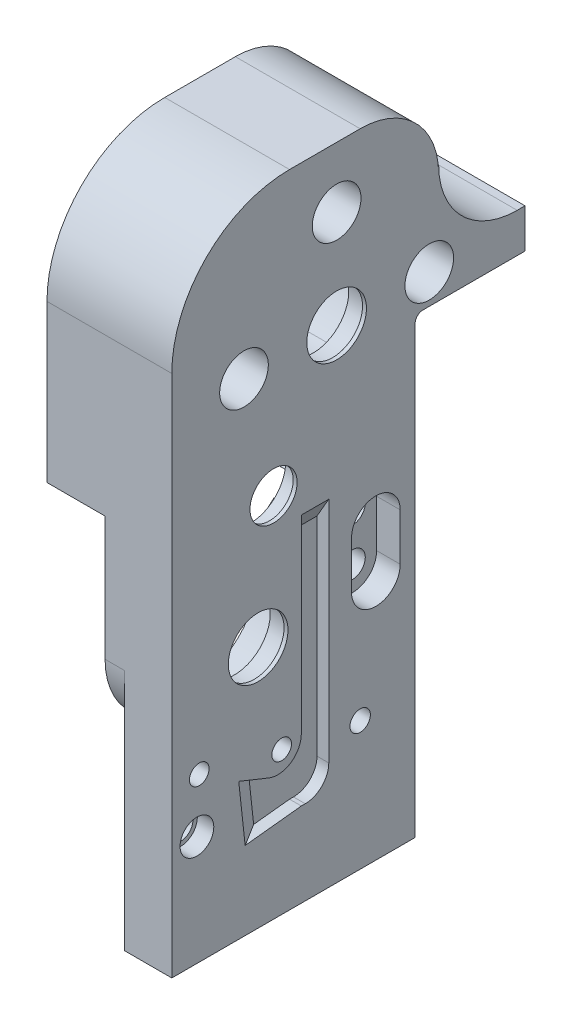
ISO-10303-21;
HEADER;
FILE_DESCRIPTION(('STEP AP214'),'2;1');
FILE_NAME('part.step','',(''),(''),'','','');
FILE_SCHEMA(('AUTOMOTIVE_DESIGN { 1 0 10303 214 1 1 1 1 }'));
ENDSEC;
DATA;
#1=APPLICATION_CONTEXT('core data for automotive mechanical design processes');
#2=APPLICATION_PROTOCOL_DEFINITION('international standard','automotive_design',2000,#1);
#3=PRODUCT_CONTEXT('',#1,'mechanical');
#4=PRODUCT('Part','Part','',(#3));
#5=PRODUCT_RELATED_PRODUCT_CATEGORY('part','',(#4));
#6=PRODUCT_DEFINITION_FORMATION('','',#4);
#7=PRODUCT_DEFINITION_CONTEXT('part definition',#1,'design');
#8=PRODUCT_DEFINITION('design','',#6,#7);
#9=PRODUCT_DEFINITION_SHAPE('','',#8);
#10=(LENGTH_UNIT() NAMED_UNIT(*) SI_UNIT(.MILLI.,.METRE.));
#11=(NAMED_UNIT(*) PLANE_ANGLE_UNIT() SI_UNIT($,.RADIAN.));
#12=(NAMED_UNIT(*) SI_UNIT($,.STERADIAN.) SOLID_ANGLE_UNIT());
#13=UNCERTAINTY_MEASURE_WITH_UNIT(LENGTH_MEASURE(1.E-05),#10,'distance_accuracy_value','');
#14=(GEOMETRIC_REPRESENTATION_CONTEXT(3) GLOBAL_UNCERTAINTY_ASSIGNED_CONTEXT((#13)) GLOBAL_UNIT_ASSIGNED_CONTEXT((#10,
#11,#12)) REPRESENTATION_CONTEXT('',''));
#15=CARTESIAN_POINT('',(0.,0.,0.));
#16=DIRECTION('',(0.,0.,1.));
#17=DIRECTION('',(1.,0.,0.));
#18=AXIS2_PLACEMENT_3D('',#15,#16,#17);
#19=CARTESIAN_POINT('',(12.8693434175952,46.7128151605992,2.53666998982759));
#20=DIRECTION('',(-1.,0.,0.));
#21=DIRECTION('',(0.,0.,1.));
#22=AXIS2_PLACEMENT_3D('',#19,#20,#21);
#23=CYLINDRICAL_SURFACE('',#22,4.55);
#24=CARTESIAN_POINT('',(-0.5,46.7128151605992,2.53666998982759));
#25=DIRECTION('',(-1.,0.,0.));
#26=DIRECTION('',(0.,0.,1.));
#27=AXIS2_PLACEMENT_3D('',#24,#25,#26);
#28=CIRCLE('',#27,4.55);
#29=CARTESIAN_POINT('',(-0.5,46.7128151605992,7.08666998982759));
#30=VERTEX_POINT('',#29);
#31=EDGE_CURVE('E516',#30,#30,#28,.F.);
#32=ORIENTED_EDGE('',*,*,#31,.T.);
#33=EDGE_LOOP('',(#32));
#34=FACE_BOUND('',#33,.T.);
#35=CARTESIAN_POINT('',(-3.,46.7128151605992,2.53666998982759));
#36=DIRECTION('',(-1.,0.,0.));
#37=DIRECTION('',(0.,0.,1.));
#38=AXIS2_PLACEMENT_3D('',#35,#36,#37);
#39=CIRCLE('',#38,4.55);
#40=CARTESIAN_POINT('',(-3.,46.7128151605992,7.08666998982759));
#41=VERTEX_POINT('',#40);
#42=EDGE_CURVE('E442',#41,#41,#39,.F.);
#43=ORIENTED_EDGE('',*,*,#42,.F.);
#44=EDGE_LOOP('',(#43));
#45=FACE_BOUND('',#44,.T.);
#46=ADVANCED_FACE('F34',(#34,#45),#23,.F.);
#47=CARTESIAN_POINT('',(12.8693434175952,61.5,-5.5));
#48=DIRECTION('',(-1.,0.,0.));
#49=DIRECTION('',(0.,0.,1.));
#50=AXIS2_PLACEMENT_3D('',#47,#48,#49);
#51=CYLINDRICAL_SURFACE('',#50,4.55);
#52=CARTESIAN_POINT('',(-0.5,61.5,-5.5));
#53=DIRECTION('',(-1.,0.,0.));
#54=DIRECTION('',(0.,0.,1.));
#55=AXIS2_PLACEMENT_3D('',#52,#53,#54);
#56=CIRCLE('',#55,4.55);
#57=CARTESIAN_POINT('',(-0.5,61.5,-0.950000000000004));
#58=VERTEX_POINT('',#57);
#59=EDGE_CURVE('E507',#58,#58,#56,.F.);
#60=ORIENTED_EDGE('',*,*,#59,.T.);
#61=EDGE_LOOP('',(#60));
#62=FACE_BOUND('',#61,.T.);
#63=CARTESIAN_POINT('',(-3.,61.5,-5.5));
#64=DIRECTION('',(-1.,0.,0.));
#65=DIRECTION('',(0.,0.,1.));
#66=AXIS2_PLACEMENT_3D('',#63,#64,#65);
#67=CIRCLE('',#66,4.55);
#68=CARTESIAN_POINT('',(-3.,61.5,-0.950000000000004));
#69=VERTEX_POINT('',#68);
#70=EDGE_CURVE('E439',#69,#69,#67,.F.);
#71=ORIENTED_EDGE('',*,*,#70,.F.);
#72=EDGE_LOOP('',(#71));
#73=FACE_BOUND('',#72,.T.);
#74=ADVANCED_FACE('F864',(#62,#73),#51,.F.);
#75=CARTESIAN_POINT('',(12.8693434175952,31.,4.50000000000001));
#76=DIRECTION('',(-1.,0.,0.));
#77=DIRECTION('',(0.,0.,1.));
#78=AXIS2_PLACEMENT_3D('',#75,#76,#77);
#79=CYLINDRICAL_SURFACE('',#78,4.55);
#80=CARTESIAN_POINT('',(-0.5,31.,4.50000000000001));
#81=DIRECTION('',(-1.,0.,0.));
#82=DIRECTION('',(0.,0.,1.));
#83=AXIS2_PLACEMENT_3D('',#80,#81,#82);
#84=CIRCLE('',#83,4.55);
#85=CARTESIAN_POINT('',(-0.5,31.,9.05000000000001));
#86=VERTEX_POINT('',#85);
#87=EDGE_CURVE('E512',#86,#86,#84,.F.);
#88=ORIENTED_EDGE('',*,*,#87,.T.);
#89=EDGE_LOOP('',(#88));
#90=FACE_BOUND('',#89,.T.);
#91=CARTESIAN_POINT('',(-3.,31.,4.50000000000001));
#92=DIRECTION('',(-1.,0.,0.));
#93=DIRECTION('',(0.,0.,1.));
#94=AXIS2_PLACEMENT_3D('',#91,#92,#93);
#95=CIRCLE('',#94,4.55);
#96=CARTESIAN_POINT('',(-3.,31.,9.05000000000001));
#97=VERTEX_POINT('',#96);
#98=EDGE_CURVE('E437',#97,#97,#95,.F.);
#99=ORIENTED_EDGE('',*,*,#98,.F.);
#100=EDGE_LOOP('',(#99));
#101=FACE_BOUND('',#100,.T.);
#102=ADVANCED_FACE('F870',(#90,#101),#79,.F.);
#103=CARTESIAN_POINT('',(-6.001,31.,4.50000000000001));
#104=DIRECTION('',(1.,0.,0.));
#105=DIRECTION('',(0.,0.,-1.));
#106=AXIS2_PLACEMENT_3D('',#103,#104,#105);
#107=CYLINDRICAL_SURFACE('',#106,3.8);
#108=CARTESIAN_POINT('',(0.,31.,4.50000000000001));
#109=DIRECTION('',(1.,0.,0.));
#110=DIRECTION('',(0.,0.,-1.));
#111=AXIS2_PLACEMENT_3D('',#108,#109,#110);
#112=CIRCLE('',#111,3.8);
#113=CARTESIAN_POINT('',(0.,31.,0.700000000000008));
#114=VERTEX_POINT('',#113);
#115=EDGE_CURVE('E708',#114,#114,#112,.T.);
#116=CARTESIAN_POINT('',(-0.5,31.,4.50000000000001));
#117=DIRECTION('',(-1.,0.,0.));
#118=DIRECTION('',(0.,0.,1.));
#119=AXIS2_PLACEMENT_3D('',#116,#117,#118);
#120=CIRCLE('',#119,3.8);
#121=CARTESIAN_POINT('',(-0.499999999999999,31.,0.700000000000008));
#122=VERTEX_POINT('',#121);
#123=EDGE_CURVE('E549',#122,#122,#120,.F.);
#124=CARTESIAN_POINT('',(0.,31.,0.700000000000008));
#125=CARTESIAN_POINT('',(-0.00520833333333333,31.,0.700000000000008));
#126=CARTESIAN_POINT('',(-0.0104166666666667,31.,0.700000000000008));
#127=CARTESIAN_POINT('',(-0.0208333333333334,31.,0.700000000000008));
#128=CARTESIAN_POINT('',(-0.0260416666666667,31.,0.700000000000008));
#129=CARTESIAN_POINT('',(-0.0364583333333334,31.,0.700000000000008));
#130=CARTESIAN_POINT('',(-0.0416666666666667,31.,0.700000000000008));
#131=CARTESIAN_POINT('',(-0.0520833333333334,31.,0.700000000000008));
#132=CARTESIAN_POINT('',(-0.0572916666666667,31.,0.700000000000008));
#133=CARTESIAN_POINT('',(-0.0677083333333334,31.,0.700000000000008));
#134=CARTESIAN_POINT('',(-0.0729166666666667,31.,0.700000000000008));
#135=CARTESIAN_POINT('',(-0.0833333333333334,31.,0.700000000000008));
#136=CARTESIAN_POINT('',(-0.0885416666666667,31.,0.700000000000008));
#137=CARTESIAN_POINT('',(-0.0989583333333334,31.,0.700000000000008));
#138=CARTESIAN_POINT('',(-0.104166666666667,31.,0.700000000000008));
#139=CARTESIAN_POINT('',(-0.114583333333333,31.,0.700000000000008));
#140=CARTESIAN_POINT('',(-0.119791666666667,31.,0.700000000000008));
#141=CARTESIAN_POINT('',(-0.130208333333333,31.,0.700000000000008));
#142=CARTESIAN_POINT('',(-0.135416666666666,31.,0.700000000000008));
#143=CARTESIAN_POINT('',(-0.145833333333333,31.,0.700000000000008));
#144=CARTESIAN_POINT('',(-0.151041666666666,31.,0.700000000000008));
#145=CARTESIAN_POINT('',(-0.161458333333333,31.,0.700000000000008));
#146=CARTESIAN_POINT('',(-0.166666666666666,31.,0.700000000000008));
#147=CARTESIAN_POINT('',(-0.177083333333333,31.,0.700000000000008));
#148=CARTESIAN_POINT('',(-0.182291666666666,31.,0.700000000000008));
#149=CARTESIAN_POINT('',(-0.192708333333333,31.,0.700000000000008));
#150=CARTESIAN_POINT('',(-0.197916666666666,31.,0.700000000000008));
#151=CARTESIAN_POINT('',(-0.208333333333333,31.,0.700000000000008));
#152=CARTESIAN_POINT('',(-0.213541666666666,31.,0.700000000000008));
#153=CARTESIAN_POINT('',(-0.223958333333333,31.,0.700000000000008));
#154=CARTESIAN_POINT('',(-0.229166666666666,31.,0.700000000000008));
#155=CARTESIAN_POINT('',(-0.239583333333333,31.,0.700000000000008));
#156=CARTESIAN_POINT('',(-0.244791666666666,31.,0.700000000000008));
#157=CARTESIAN_POINT('',(-0.255208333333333,31.,0.700000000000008));
#158=CARTESIAN_POINT('',(-0.260416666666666,31.,0.700000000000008));
#159=CARTESIAN_POINT('',(-0.270833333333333,31.,0.700000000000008));
#160=CARTESIAN_POINT('',(-0.276041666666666,31.,0.700000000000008));
#161=CARTESIAN_POINT('',(-0.286458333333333,31.,0.700000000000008));
#162=CARTESIAN_POINT('',(-0.291666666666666,31.,0.700000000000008));
#163=CARTESIAN_POINT('',(-0.302083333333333,31.,0.700000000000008));
#164=CARTESIAN_POINT('',(-0.307291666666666,31.,0.700000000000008));
#165=CARTESIAN_POINT('',(-0.317708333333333,31.,0.700000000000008));
#166=CARTESIAN_POINT('',(-0.322916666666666,31.,0.700000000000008));
#167=CARTESIAN_POINT('',(-0.333333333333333,31.,0.700000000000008));
#168=CARTESIAN_POINT('',(-0.338541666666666,31.,0.700000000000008));
#169=CARTESIAN_POINT('',(-0.348958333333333,31.,0.700000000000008));
#170=CARTESIAN_POINT('',(-0.354166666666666,31.,0.700000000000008));
#171=CARTESIAN_POINT('',(-0.364583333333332,31.,0.700000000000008));
#172=CARTESIAN_POINT('',(-0.369791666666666,31.,0.700000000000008));
#173=CARTESIAN_POINT('',(-0.380208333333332,31.,0.700000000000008));
#174=CARTESIAN_POINT('',(-0.385416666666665,31.,0.700000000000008));
#175=CARTESIAN_POINT('',(-0.395833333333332,31.,0.700000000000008));
#176=CARTESIAN_POINT('',(-0.401041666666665,31.,0.700000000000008));
#177=CARTESIAN_POINT('',(-0.411458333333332,31.,0.700000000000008));
#178=CARTESIAN_POINT('',(-0.416666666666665,31.,0.700000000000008));
#179=CARTESIAN_POINT('',(-0.427083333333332,31.,0.700000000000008));
#180=CARTESIAN_POINT('',(-0.432291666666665,31.,0.700000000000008));
#181=CARTESIAN_POINT('',(-0.442708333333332,31.,0.700000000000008));
#182=CARTESIAN_POINT('',(-0.447916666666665,31.,0.700000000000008));
#183=CARTESIAN_POINT('',(-0.458333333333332,31.,0.700000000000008));
#184=CARTESIAN_POINT('',(-0.463541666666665,31.,0.700000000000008));
#185=CARTESIAN_POINT('',(-0.473958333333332,31.,0.700000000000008));
#186=CARTESIAN_POINT('',(-0.479166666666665,31.,0.700000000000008));
#187=CARTESIAN_POINT('',(-0.489583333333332,31.,0.700000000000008));
#188=CARTESIAN_POINT('',(-0.494791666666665,31.,0.700000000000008));
#189=CARTESIAN_POINT('',(-0.499999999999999,31.,0.700000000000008));
#190=B_SPLINE_CURVE_WITH_KNOTS('',3,(#124,#125,#126,#127,#128,#129,#130,#131,#132,#133,#134,
#135,#136,#137,#138,#139,#140,#141,#142,#143,#144,#145,#146,#147,#148,#149,#150,#151,#152,#153,
#154,#155,#156,#157,#158,#159,#160,#161,#162,#163,#164,#165,#166,#167,#168,#169,#170,#171,#172,
#173,#174,#175,#176,#177,#178,#179,#180,#181,#182,#183,#184,#185,#186,#187,#188,#189),
.UNSPECIFIED.,.F.,.F.,(4,2,2,2,2,2,2,2,2,2,2,2,2,2,2,2,2,2,2,2,2,2,2,2,2,2,2,2,2,2,2,2,4),(0.,
0.015625,0.03125,0.046875,0.0625000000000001,0.0781250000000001,0.0937500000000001,0.109375,
0.125,0.140624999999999,0.156249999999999,0.171874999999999,0.187499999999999,0.203124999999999,
0.218749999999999,0.234374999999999,0.249999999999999,0.265624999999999,0.281249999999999,
0.296874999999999,0.312499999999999,0.328124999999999,0.343749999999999,0.359374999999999,
0.374999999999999,0.390624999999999,0.406249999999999,0.421874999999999,0.437499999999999,
0.453124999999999,0.468749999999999,0.484374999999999,0.499999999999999),.UNSPECIFIED.);
#191=EDGE_CURVE('BSEAM1030',#114,#122,#190,.T.);
#192=ORIENTED_EDGE('',*,*,#115,.T.);
#193=ORIENTED_EDGE('',*,*,#123,.F.);
#194=ORIENTED_EDGE('',*,*,#191,.T.);
#195=ORIENTED_EDGE('',*,*,#191,.F.);
#196=EDGE_LOOP('',(#192,#194,#193,#195));
#197=FACE_BOUND('',#196,.T.);
#198=ADVANCED_FACE('F1030',(#197),#107,.F.);
#199=CARTESIAN_POINT('',(-6.001,61.5,-5.5));
#200=DIRECTION('',(1.,0.,0.));
#201=DIRECTION('',(0.,0.,-1.));
#202=AXIS2_PLACEMENT_3D('',#199,#200,#201);
#203=CYLINDRICAL_SURFACE('',#202,3.8);
#204=CARTESIAN_POINT('',(0.,61.5,-5.5));
#205=DIRECTION('',(1.,0.,0.));
#206=DIRECTION('',(0.,0.,-1.));
#207=AXIS2_PLACEMENT_3D('',#204,#205,#206);
#208=CIRCLE('',#207,3.8);
#209=CARTESIAN_POINT('',(0.,61.5,-9.3));
#210=VERTEX_POINT('',#209);
#211=EDGE_CURVE('E715',#210,#210,#208,.T.);
#212=CARTESIAN_POINT('',(-0.5,61.5,-5.5));
#213=DIRECTION('',(-1.,0.,0.));
#214=DIRECTION('',(0.,0.,1.));
#215=AXIS2_PLACEMENT_3D('',#212,#213,#214);
#216=CIRCLE('',#215,3.8);
#217=CARTESIAN_POINT('',(-0.499999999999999,61.5,-9.3));
#218=VERTEX_POINT('',#217);
#219=EDGE_CURVE('E814',#218,#218,#216,.F.);
#220=CARTESIAN_POINT('',(0.,61.5,-9.3));
#221=CARTESIAN_POINT('',(-0.00520833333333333,61.5,-9.3));
#222=CARTESIAN_POINT('',(-0.0104166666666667,61.5,-9.3));
#223=CARTESIAN_POINT('',(-0.0208333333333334,61.5,-9.3));
#224=CARTESIAN_POINT('',(-0.0260416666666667,61.5,-9.3));
#225=CARTESIAN_POINT('',(-0.0364583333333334,61.5,-9.3));
#226=CARTESIAN_POINT('',(-0.0416666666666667,61.5,-9.3));
#227=CARTESIAN_POINT('',(-0.0520833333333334,61.5,-9.3));
#228=CARTESIAN_POINT('',(-0.0572916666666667,61.5,-9.3));
#229=CARTESIAN_POINT('',(-0.0677083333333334,61.5,-9.3));
#230=CARTESIAN_POINT('',(-0.0729166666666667,61.5,-9.3));
#231=CARTESIAN_POINT('',(-0.0833333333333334,61.5,-9.3));
#232=CARTESIAN_POINT('',(-0.0885416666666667,61.5,-9.3));
#233=CARTESIAN_POINT('',(-0.0989583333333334,61.5,-9.3));
#234=CARTESIAN_POINT('',(-0.104166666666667,61.5,-9.3));
#235=CARTESIAN_POINT('',(-0.114583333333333,61.5,-9.3));
#236=CARTESIAN_POINT('',(-0.119791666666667,61.5,-9.3));
#237=CARTESIAN_POINT('',(-0.130208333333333,61.5,-9.3));
#238=CARTESIAN_POINT('',(-0.135416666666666,61.5,-9.3));
#239=CARTESIAN_POINT('',(-0.145833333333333,61.5,-9.3));
#240=CARTESIAN_POINT('',(-0.151041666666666,61.5,-9.3));
#241=CARTESIAN_POINT('',(-0.161458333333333,61.5,-9.3));
#242=CARTESIAN_POINT('',(-0.166666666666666,61.5,-9.3));
#243=CARTESIAN_POINT('',(-0.177083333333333,61.5,-9.3));
#244=CARTESIAN_POINT('',(-0.182291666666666,61.5,-9.3));
#245=CARTESIAN_POINT('',(-0.192708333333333,61.5,-9.3));
#246=CARTESIAN_POINT('',(-0.197916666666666,61.5,-9.3));
#247=CARTESIAN_POINT('',(-0.208333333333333,61.5,-9.3));
#248=CARTESIAN_POINT('',(-0.213541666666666,61.5,-9.3));
#249=CARTESIAN_POINT('',(-0.223958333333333,61.5,-9.3));
#250=CARTESIAN_POINT('',(-0.229166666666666,61.5,-9.3));
#251=CARTESIAN_POINT('',(-0.239583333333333,61.5,-9.3));
#252=CARTESIAN_POINT('',(-0.244791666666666,61.5,-9.3));
#253=CARTESIAN_POINT('',(-0.255208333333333,61.5,-9.3));
#254=CARTESIAN_POINT('',(-0.260416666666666,61.5,-9.3));
#255=CARTESIAN_POINT('',(-0.270833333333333,61.5,-9.3));
#256=CARTESIAN_POINT('',(-0.276041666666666,61.5,-9.3));
#257=CARTESIAN_POINT('',(-0.286458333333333,61.5,-9.3));
#258=CARTESIAN_POINT('',(-0.291666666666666,61.5,-9.3));
#259=CARTESIAN_POINT('',(-0.302083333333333,61.5,-9.3));
#260=CARTESIAN_POINT('',(-0.307291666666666,61.5,-9.3));
#261=CARTESIAN_POINT('',(-0.317708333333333,61.5,-9.3));
#262=CARTESIAN_POINT('',(-0.322916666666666,61.5,-9.3));
#263=CARTESIAN_POINT('',(-0.333333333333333,61.5,-9.3));
#264=CARTESIAN_POINT('',(-0.338541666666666,61.5,-9.3));
#265=CARTESIAN_POINT('',(-0.348958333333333,61.5,-9.3));
#266=CARTESIAN_POINT('',(-0.354166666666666,61.5,-9.3));
#267=CARTESIAN_POINT('',(-0.364583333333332,61.5,-9.3));
#268=CARTESIAN_POINT('',(-0.369791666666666,61.5,-9.3));
#269=CARTESIAN_POINT('',(-0.380208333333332,61.5,-9.3));
#270=CARTESIAN_POINT('',(-0.385416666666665,61.5,-9.3));
#271=CARTESIAN_POINT('',(-0.395833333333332,61.5,-9.3));
#272=CARTESIAN_POINT('',(-0.401041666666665,61.5,-9.3));
#273=CARTESIAN_POINT('',(-0.411458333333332,61.5,-9.3));
#274=CARTESIAN_POINT('',(-0.416666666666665,61.5,-9.3));
#275=CARTESIAN_POINT('',(-0.427083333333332,61.5,-9.3));
#276=CARTESIAN_POINT('',(-0.432291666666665,61.5,-9.3));
#277=CARTESIAN_POINT('',(-0.442708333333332,61.5,-9.3));
#278=CARTESIAN_POINT('',(-0.447916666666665,61.5,-9.3));
#279=CARTESIAN_POINT('',(-0.458333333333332,61.5,-9.3));
#280=CARTESIAN_POINT('',(-0.463541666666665,61.5,-9.3));
#281=CARTESIAN_POINT('',(-0.473958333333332,61.5,-9.3));
#282=CARTESIAN_POINT('',(-0.479166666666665,61.5,-9.3));
#283=CARTESIAN_POINT('',(-0.489583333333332,61.5,-9.3));
#284=CARTESIAN_POINT('',(-0.494791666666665,61.5,-9.3));
#285=CARTESIAN_POINT('',(-0.499999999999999,61.5,-9.3));
#286=B_SPLINE_CURVE_WITH_KNOTS('',3,(#220,#221,#222,#223,#224,#225,#226,#227,#228,#229,#230,
#231,#232,#233,#234,#235,#236,#237,#238,#239,#240,#241,#242,#243,#244,#245,#246,#247,#248,#249,
#250,#251,#252,#253,#254,#255,#256,#257,#258,#259,#260,#261,#262,#263,#264,#265,#266,#267,#268,
#269,#270,#271,#272,#273,#274,#275,#276,#277,#278,#279,#280,#281,#282,#283,#284,#285),
.UNSPECIFIED.,.F.,.F.,(4,2,2,2,2,2,2,2,2,2,2,2,2,2,2,2,2,2,2,2,2,2,2,2,2,2,2,2,2,2,2,2,4),(0.,
0.015625,0.03125,0.046875,0.0625000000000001,0.0781250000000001,0.0937500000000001,0.109375,
0.125,0.140624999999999,0.156249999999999,0.171874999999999,0.187499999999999,0.203124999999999,
0.218749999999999,0.234374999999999,0.249999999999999,0.265624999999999,0.281249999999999,
0.296874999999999,0.312499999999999,0.328124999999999,0.343749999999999,0.359374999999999,
0.374999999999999,0.390624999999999,0.406249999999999,0.421874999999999,0.437499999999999,
0.453124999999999,0.468749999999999,0.484374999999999,0.499999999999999),.UNSPECIFIED.);
#287=EDGE_CURVE('BSEAM995',#210,#218,#286,.T.);
#288=ORIENTED_EDGE('',*,*,#211,.T.);
#289=ORIENTED_EDGE('',*,*,#219,.F.);
#290=ORIENTED_EDGE('',*,*,#287,.T.);
#291=ORIENTED_EDGE('',*,*,#287,.F.);
#292=EDGE_LOOP('',(#288,#290,#289,#291));
#293=FACE_BOUND('',#292,.T.);
#294=ADVANCED_FACE('F995',(#293),#203,.F.);
#295=CARTESIAN_POINT('',(0.00100000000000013,46.7128151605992,2.53666998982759));
#296=DIRECTION('',(-1.,0.,0.));
#297=DIRECTION('',(0.,0.,1.));
#298=AXIS2_PLACEMENT_3D('',#295,#296,#297);
#299=CYLINDRICAL_SURFACE('',#298,3.);
#300=CARTESIAN_POINT('',(0.,46.7128151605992,2.53666998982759));
#301=DIRECTION('',(-1.,0.,0.));
#302=DIRECTION('',(0.,0.,1.));
#303=AXIS2_PLACEMENT_3D('',#300,#301,#302);
#304=CIRCLE('',#303,3.);
#305=CARTESIAN_POINT('',(0.,46.7128151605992,5.5366699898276));
#306=VERTEX_POINT('',#305);
#307=EDGE_CURVE('E683',#306,#306,#304,.F.);
#308=CARTESIAN_POINT('',(-0.5,46.7128151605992,2.53666998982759));
#309=DIRECTION('',(-1.,0.,0.));
#310=DIRECTION('',(0.,0.,1.));
#311=AXIS2_PLACEMENT_3D('',#308,#309,#310);
#312=CIRCLE('',#311,3.);
#313=CARTESIAN_POINT('',(-0.5,46.7128151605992,5.5366699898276));
#314=VERTEX_POINT('',#313);
#315=EDGE_CURVE('E515',#314,#314,#312,.F.);
#316=CARTESIAN_POINT('',(0.,46.7128151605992,5.5366699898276));
#317=CARTESIAN_POINT('',(-0.00520833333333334,46.7128151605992,5.5366699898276));
#318=CARTESIAN_POINT('',(-0.0104166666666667,46.7128151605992,5.5366699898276));
#319=CARTESIAN_POINT('',(-0.0208333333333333,46.7128151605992,5.5366699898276));
#320=CARTESIAN_POINT('',(-0.0260416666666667,46.7128151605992,5.5366699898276));
#321=CARTESIAN_POINT('',(-0.0364583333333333,46.7128151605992,5.5366699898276));
#322=CARTESIAN_POINT('',(-0.0416666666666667,46.7128151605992,5.5366699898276));
#323=CARTESIAN_POINT('',(-0.0520833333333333,46.7128151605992,5.5366699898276));
#324=CARTESIAN_POINT('',(-0.0572916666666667,46.7128151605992,5.5366699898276));
#325=CARTESIAN_POINT('',(-0.0677083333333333,46.7128151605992,5.5366699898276));
#326=CARTESIAN_POINT('',(-0.0729166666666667,46.7128151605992,5.5366699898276));
#327=CARTESIAN_POINT('',(-0.0833333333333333,46.7128151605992,5.5366699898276));
#328=CARTESIAN_POINT('',(-0.0885416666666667,46.7128151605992,5.5366699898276));
#329=CARTESIAN_POINT('',(-0.0989583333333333,46.7128151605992,5.5366699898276));
#330=CARTESIAN_POINT('',(-0.104166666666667,46.7128151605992,5.5366699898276));
#331=CARTESIAN_POINT('',(-0.114583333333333,46.7128151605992,5.5366699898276));
#332=CARTESIAN_POINT('',(-0.119791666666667,46.7128151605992,5.5366699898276));
#333=CARTESIAN_POINT('',(-0.130208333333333,46.7128151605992,5.5366699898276));
#334=CARTESIAN_POINT('',(-0.135416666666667,46.7128151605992,5.5366699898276));
#335=CARTESIAN_POINT('',(-0.145833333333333,46.7128151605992,5.5366699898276));
#336=CARTESIAN_POINT('',(-0.151041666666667,46.7128151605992,5.5366699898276));
#337=CARTESIAN_POINT('',(-0.161458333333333,46.7128151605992,5.5366699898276));
#338=CARTESIAN_POINT('',(-0.166666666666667,46.7128151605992,5.5366699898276));
#339=CARTESIAN_POINT('',(-0.177083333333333,46.7128151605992,5.5366699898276));
#340=CARTESIAN_POINT('',(-0.182291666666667,46.7128151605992,5.5366699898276));
#341=CARTESIAN_POINT('',(-0.192708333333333,46.7128151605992,5.5366699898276));
#342=CARTESIAN_POINT('',(-0.197916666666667,46.7128151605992,5.5366699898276));
#343=CARTESIAN_POINT('',(-0.208333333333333,46.7128151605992,5.5366699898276));
#344=CARTESIAN_POINT('',(-0.213541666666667,46.7128151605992,5.5366699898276));
#345=CARTESIAN_POINT('',(-0.223958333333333,46.7128151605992,5.5366699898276));
#346=CARTESIAN_POINT('',(-0.229166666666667,46.7128151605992,5.5366699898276));
#347=CARTESIAN_POINT('',(-0.239583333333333,46.7128151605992,5.5366699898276));
#348=CARTESIAN_POINT('',(-0.244791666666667,46.7128151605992,5.5366699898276));
#349=CARTESIAN_POINT('',(-0.255208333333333,46.7128151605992,5.5366699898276));
#350=CARTESIAN_POINT('',(-0.260416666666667,46.7128151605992,5.5366699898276));
#351=CARTESIAN_POINT('',(-0.270833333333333,46.7128151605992,5.5366699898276));
#352=CARTESIAN_POINT('',(-0.276041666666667,46.7128151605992,5.5366699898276));
#353=CARTESIAN_POINT('',(-0.286458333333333,46.7128151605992,5.5366699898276));
#354=CARTESIAN_POINT('',(-0.291666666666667,46.7128151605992,5.5366699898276));
#355=CARTESIAN_POINT('',(-0.302083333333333,46.7128151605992,5.5366699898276));
#356=CARTESIAN_POINT('',(-0.307291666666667,46.7128151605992,5.5366699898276));
#357=CARTESIAN_POINT('',(-0.317708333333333,46.7128151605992,5.5366699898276));
#358=CARTESIAN_POINT('',(-0.322916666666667,46.7128151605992,5.5366699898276));
#359=CARTESIAN_POINT('',(-0.333333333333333,46.7128151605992,5.5366699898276));
#360=CARTESIAN_POINT('',(-0.338541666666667,46.7128151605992,5.5366699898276));
#361=CARTESIAN_POINT('',(-0.348958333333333,46.7128151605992,5.5366699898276));
#362=CARTESIAN_POINT('',(-0.354166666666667,46.7128151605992,5.5366699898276));
#363=CARTESIAN_POINT('',(-0.364583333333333,46.7128151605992,5.5366699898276));
#364=CARTESIAN_POINT('',(-0.369791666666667,46.7128151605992,5.5366699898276));
#365=CARTESIAN_POINT('',(-0.380208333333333,46.7128151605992,5.5366699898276));
#366=CARTESIAN_POINT('',(-0.385416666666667,46.7128151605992,5.5366699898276));
#367=CARTESIAN_POINT('',(-0.395833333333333,46.7128151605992,5.5366699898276));
#368=CARTESIAN_POINT('',(-0.401041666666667,46.7128151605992,5.5366699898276));
#369=CARTESIAN_POINT('',(-0.411458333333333,46.7128151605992,5.5366699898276));
#370=CARTESIAN_POINT('',(-0.416666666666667,46.7128151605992,5.5366699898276));
#371=CARTESIAN_POINT('',(-0.427083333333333,46.7128151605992,5.5366699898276));
#372=CARTESIAN_POINT('',(-0.432291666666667,46.7128151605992,5.5366699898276));
#373=CARTESIAN_POINT('',(-0.442708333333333,46.7128151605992,5.5366699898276));
#374=CARTESIAN_POINT('',(-0.447916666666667,46.7128151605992,5.5366699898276));
#375=CARTESIAN_POINT('',(-0.458333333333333,46.7128151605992,5.5366699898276));
#376=CARTESIAN_POINT('',(-0.463541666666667,46.7128151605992,5.5366699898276));
#377=CARTESIAN_POINT('',(-0.473958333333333,46.7128151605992,5.5366699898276));
#378=CARTESIAN_POINT('',(-0.479166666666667,46.7128151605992,5.5366699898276));
#379=CARTESIAN_POINT('',(-0.489583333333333,46.7128151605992,5.5366699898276));
#380=CARTESIAN_POINT('',(-0.494791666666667,46.7128151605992,5.5366699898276));
#381=CARTESIAN_POINT('',(-0.5,46.7128151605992,5.5366699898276));
#382=B_SPLINE_CURVE_WITH_KNOTS('',3,(#316,#317,#318,#319,#320,#321,#322,#323,#324,#325,#326,
#327,#328,#329,#330,#331,#332,#333,#334,#335,#336,#337,#338,#339,#340,#341,#342,#343,#344,#345,
#346,#347,#348,#349,#350,#351,#352,#353,#354,#355,#356,#357,#358,#359,#360,#361,#362,#363,#364,
#365,#366,#367,#368,#369,#370,#371,#372,#373,#374,#375,#376,#377,#378,#379,#380,#381),
.UNSPECIFIED.,.F.,.F.,(4,2,2,2,2,2,2,2,2,2,2,2,2,2,2,2,2,2,2,2,2,2,2,2,2,2,2,2,2,2,2,2,4),(0.,
0.015625,0.03125,0.046875,0.0625,0.078125,0.09375,0.109375,0.125,0.140625,0.15625,0.171875,
0.1875,0.203125,0.21875,0.234375,0.25,0.265625,0.28125,0.296875,0.3125,0.328125,0.34375,
0.359375,0.375,0.390625,0.40625,0.421875,0.4375,0.453125,0.46875,0.484375,0.5),.UNSPECIFIED.);
#383=EDGE_CURVE('BSEAM940',#306,#314,#382,.T.);
#384=ORIENTED_EDGE('',*,*,#307,.T.);
#385=ORIENTED_EDGE('',*,*,#315,.F.);
#386=ORIENTED_EDGE('',*,*,#383,.T.);
#387=ORIENTED_EDGE('',*,*,#383,.F.);
#388=EDGE_LOOP('',(#384,#386,#385,#387));
#389=FACE_BOUND('',#388,.T.);
#390=ADVANCED_FACE('F940',(#389),#299,.F.);
#391=CARTESIAN_POINT('',(-15.901,61.5,6.3));
#392=DIRECTION('',(1.,0.,0.));
#393=DIRECTION('',(0.,0.,-1.));
#394=AXIS2_PLACEMENT_3D('',#391,#392,#393);
#395=CYLINDRICAL_SURFACE('',#394,2.);
#396=CARTESIAN_POINT('',(-15.9,61.5,6.3));
#397=DIRECTION('',(-1.,0.,0.));
#398=DIRECTION('',(0.,0.,1.));
#399=AXIS2_PLACEMENT_3D('',#396,#397,#398);
#400=CIRCLE('',#399,2.);
#401=CARTESIAN_POINT('',(-15.9,61.5,8.3));
#402=VERTEX_POINT('',#401);
#403=EDGE_CURVE('E574',#402,#402,#400,.F.);
#404=ORIENTED_EDGE('',*,*,#403,.F.);
#405=EDGE_LOOP('',(#404));
#406=FACE_BOUND('',#405,.T.);
#407=CARTESIAN_POINT('',(-8.,61.5,6.3));
#408=DIRECTION('',(1.,0.,0.));
#409=DIRECTION('',(0.,0.,-1.));
#410=AXIS2_PLACEMENT_3D('',#407,#408,#409);
#411=CIRCLE('',#410,2.);
#412=CARTESIAN_POINT('',(-8.,61.5,4.3));
#413=VERTEX_POINT('',#412);
#414=EDGE_CURVE('E521',#413,#413,#411,.F.);
#415=ORIENTED_EDGE('',*,*,#414,.F.);
#416=EDGE_LOOP('',(#415));
#417=FACE_BOUND('',#416,.T.);
#418=ADVANCED_FACE('F936',(#406,#417),#395,.F.);
#419=CARTESIAN_POINT('',(-15.901,61.5,-17.3));
#420=DIRECTION('',(1.,0.,0.));
#421=DIRECTION('',(0.,0.,-1.));
#422=AXIS2_PLACEMENT_3D('',#419,#420,#421);
#423=CYLINDRICAL_SURFACE('',#422,2.);
#424=CARTESIAN_POINT('',(-15.9,61.5,-17.3));
#425=DIRECTION('',(-1.,0.,0.));
#426=DIRECTION('',(0.,0.,1.));
#427=AXIS2_PLACEMENT_3D('',#424,#425,#426);
#428=CIRCLE('',#427,2.);
#429=CARTESIAN_POINT('',(-15.9,61.5,-15.3));
#430=VERTEX_POINT('',#429);
#431=EDGE_CURVE('E585',#430,#430,#428,.F.);
#432=ORIENTED_EDGE('',*,*,#431,.F.);
#433=EDGE_LOOP('',(#432));
#434=FACE_BOUND('',#433,.T.);
#435=CARTESIAN_POINT('',(-8.,61.5,-17.3));
#436=DIRECTION('',(1.,0.,0.));
#437=DIRECTION('',(0.,0.,-1.));
#438=AXIS2_PLACEMENT_3D('',#435,#436,#437);
#439=CIRCLE('',#438,2.);
#440=CARTESIAN_POINT('',(-8.,61.5,-19.3));
#441=VERTEX_POINT('',#440);
#442=EDGE_CURVE('E532',#441,#441,#439,.F.);
#443=ORIENTED_EDGE('',*,*,#442,.F.);
#444=EDGE_LOOP('',(#443));
#445=FACE_BOUND('',#444,.T.);
#446=ADVANCED_FACE('F932',(#434,#445),#423,.F.);
#447=CARTESIAN_POINT('',(-15.901,74.,-5.5));
#448=DIRECTION('',(1.,0.,0.));
#449=DIRECTION('',(0.,0.,-1.));
#450=AXIS2_PLACEMENT_3D('',#447,#448,#449);
#451=CYLINDRICAL_SURFACE('',#450,2.);
#452=CARTESIAN_POINT('',(-15.9,74.,-5.5));
#453=DIRECTION('',(-1.,0.,0.));
#454=DIRECTION('',(0.,0.,1.));
#455=AXIS2_PLACEMENT_3D('',#452,#453,#454);
#456=CIRCLE('',#455,2.);
#457=CARTESIAN_POINT('',(-15.9,74.,-3.5));
#458=VERTEX_POINT('',#457);
#459=EDGE_CURVE('E581',#458,#458,#456,.F.);
#460=ORIENTED_EDGE('',*,*,#459,.F.);
#461=EDGE_LOOP('',(#460));
#462=FACE_BOUND('',#461,.T.);
#463=CARTESIAN_POINT('',(-8.,74.,-5.5));
#464=DIRECTION('',(1.,0.,0.));
#465=DIRECTION('',(0.,0.,-1.));
#466=AXIS2_PLACEMENT_3D('',#463,#464,#465);
#467=CIRCLE('',#466,2.);
#468=CARTESIAN_POINT('',(-8.,74.,-7.50000000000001));
#469=VERTEX_POINT('',#468);
#470=EDGE_CURVE('E541',#469,#469,#467,.F.);
#471=ORIENTED_EDGE('',*,*,#470,.F.);
#472=EDGE_LOOP('',(#471));
#473=FACE_BOUND('',#472,.T.);
#474=ADVANCED_FACE('F928',(#462,#473),#451,.F.);
#475=CARTESIAN_POINT('',(-6.001,14.,12.3));
#476=DIRECTION('',(1.,0.,0.));
#477=DIRECTION('',(0.,0.,-1.));
#478=AXIS2_PLACEMENT_3D('',#475,#476,#477);
#479=CYLINDRICAL_SURFACE('',#478,1.6);
#480=CARTESIAN_POINT('',(-6.,14.,12.3));
#481=DIRECTION('',(-1.,0.,0.));
#482=DIRECTION('',(0.,0.,1.));
#483=AXIS2_PLACEMENT_3D('',#480,#481,#482);
#484=CIRCLE('',#483,1.6);
#485=CARTESIAN_POINT('',(-6.,14.,10.7));
#486=VERTEX_POINT('',#485);
#487=EDGE_CURVE('E705',#486,#486,#484,.F.);
#488=CARTESIAN_POINT('',(-2.1,14.,12.3));
#489=DIRECTION('',(1.,0.,0.));
#490=DIRECTION('',(0.,0.,-1.));
#491=AXIS2_PLACEMENT_3D('',#488,#489,#490);
#492=CIRCLE('',#491,1.6);
#493=CARTESIAN_POINT('',(-2.1,14.,10.7));
#494=VERTEX_POINT('',#493);
#495=EDGE_CURVE('E702',#494,#494,#492,.F.);
#496=CARTESIAN_POINT('',(-6.,14.,10.7));
#497=CARTESIAN_POINT('',(-5.959375,14.,10.7));
#498=CARTESIAN_POINT('',(-5.91875,14.,10.7));
#499=CARTESIAN_POINT('',(-5.8375,14.,10.7));
#500=CARTESIAN_POINT('',(-5.796875,14.,10.7));
#501=CARTESIAN_POINT('',(-5.715625,14.,10.7));
#502=CARTESIAN_POINT('',(-5.675,14.,10.7));
#503=CARTESIAN_POINT('',(-5.59375,14.,10.7));
#504=CARTESIAN_POINT('',(-5.553125,14.,10.7));
#505=CARTESIAN_POINT('',(-5.471875,14.,10.7));
#506=CARTESIAN_POINT('',(-5.43125,14.,10.7));
#507=CARTESIAN_POINT('',(-5.35,14.,10.7));
#508=CARTESIAN_POINT('',(-5.309375,14.,10.7));
#509=CARTESIAN_POINT('',(-5.228125,14.,10.7));
#510=CARTESIAN_POINT('',(-5.1875,14.,10.7));
#511=CARTESIAN_POINT('',(-5.10625,14.,10.7));
#512=CARTESIAN_POINT('',(-5.065625,14.,10.7));
#513=CARTESIAN_POINT('',(-4.984375,14.,10.7));
#514=CARTESIAN_POINT('',(-4.94375,14.,10.7));
#515=CARTESIAN_POINT('',(-4.8625,14.,10.7));
#516=CARTESIAN_POINT('',(-4.821875,14.,10.7));
#517=CARTESIAN_POINT('',(-4.740625,14.,10.7));
#518=CARTESIAN_POINT('',(-4.7,14.,10.7));
#519=CARTESIAN_POINT('',(-4.61875,14.,10.7));
#520=CARTESIAN_POINT('',(-4.578125,14.,10.7));
#521=CARTESIAN_POINT('',(-4.496875,14.,10.7));
#522=CARTESIAN_POINT('',(-4.45625,14.,10.7));
#523=CARTESIAN_POINT('',(-4.375,14.,10.7));
#524=CARTESIAN_POINT('',(-4.334375,14.,10.7));
#525=CARTESIAN_POINT('',(-4.253125,14.,10.7));
#526=CARTESIAN_POINT('',(-4.2125,14.,10.7));
#527=CARTESIAN_POINT('',(-4.13125,14.,10.7));
#528=CARTESIAN_POINT('',(-4.090625,14.,10.7));
#529=CARTESIAN_POINT('',(-4.009375,14.,10.7));
#530=CARTESIAN_POINT('',(-3.96875,14.,10.7));
#531=CARTESIAN_POINT('',(-3.8875,14.,10.7));
#532=CARTESIAN_POINT('',(-3.846875,14.,10.7));
#533=CARTESIAN_POINT('',(-3.765625,14.,10.7));
#534=CARTESIAN_POINT('',(-3.725,14.,10.7));
#535=CARTESIAN_POINT('',(-3.64375,14.,10.7));
#536=CARTESIAN_POINT('',(-3.603125,14.,10.7));
#537=CARTESIAN_POINT('',(-3.521875,14.,10.7));
#538=CARTESIAN_POINT('',(-3.48125,14.,10.7));
#539=CARTESIAN_POINT('',(-3.4,14.,10.7));
#540=CARTESIAN_POINT('',(-3.359375,14.,10.7));
#541=CARTESIAN_POINT('',(-3.278125,14.,10.7));
#542=CARTESIAN_POINT('',(-3.2375,14.,10.7));
#543=CARTESIAN_POINT('',(-3.15625,14.,10.7));
#544=CARTESIAN_POINT('',(-3.115625,14.,10.7));
#545=CARTESIAN_POINT('',(-3.034375,14.,10.7));
#546=CARTESIAN_POINT('',(-2.99375,14.,10.7));
#547=CARTESIAN_POINT('',(-2.9125,14.,10.7));
#548=CARTESIAN_POINT('',(-2.871875,14.,10.7));
#549=CARTESIAN_POINT('',(-2.790625,14.,10.7));
#550=CARTESIAN_POINT('',(-2.75,14.,10.7));
#551=CARTESIAN_POINT('',(-2.66875,14.,10.7));
#552=CARTESIAN_POINT('',(-2.628125,14.,10.7));
#553=CARTESIAN_POINT('',(-2.546875,14.,10.7));
#554=CARTESIAN_POINT('',(-2.50625,14.,10.7));
#555=CARTESIAN_POINT('',(-2.425,14.,10.7));
#556=CARTESIAN_POINT('',(-2.384375,14.,10.7));
#557=CARTESIAN_POINT('',(-2.303125,14.,10.7));
#558=CARTESIAN_POINT('',(-2.2625,14.,10.7));
#559=CARTESIAN_POINT('',(-2.18125,14.,10.7));
#560=CARTESIAN_POINT('',(-2.140625,14.,10.7));
#561=CARTESIAN_POINT('',(-2.1,14.,10.7));
#562=B_SPLINE_CURVE_WITH_KNOTS('',3,(#496,#497,#498,#499,#500,#501,#502,#503,#504,#505,#506,
#507,#508,#509,#510,#511,#512,#513,#514,#515,#516,#517,#518,#519,#520,#521,#522,#523,#524,#525,
#526,#527,#528,#529,#530,#531,#532,#533,#534,#535,#536,#537,#538,#539,#540,#541,#542,#543,#544,
#545,#546,#547,#548,#549,#550,#551,#552,#553,#554,#555,#556,#557,#558,#559,#560,#561),
.UNSPECIFIED.,.F.,.F.,(4,2,2,2,2,2,2,2,2,2,2,2,2,2,2,2,2,2,2,2,2,2,2,2,2,2,2,2,2,2,2,2,4),(0.,
0.121875,0.243749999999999,0.365625,0.487499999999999,0.609375,0.731249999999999,
0.853124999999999,0.974999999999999,1.096875,1.21875,1.340625,1.4625,1.584375,1.70625,1.828125,
1.95,2.071875,2.19375,2.315625,2.4375,2.559375,2.68125,2.803125,2.925,3.046875,3.16875,3.290625,
3.4125,3.534375,3.65625,3.778125,3.9),.UNSPECIFIED.);
#563=EDGE_CURVE('BSEAM931',#486,#494,#562,.T.);
#564=ORIENTED_EDGE('',*,*,#487,.F.);
#565=ORIENTED_EDGE('',*,*,#495,.F.);
#566=ORIENTED_EDGE('',*,*,#563,.T.);
#567=ORIENTED_EDGE('',*,*,#563,.F.);
#568=EDGE_LOOP('',(#564,#566,#565,#567));
#569=FACE_BOUND('',#568,.T.);
#570=ADVANCED_FACE('F931',(#569),#479,.F.);
#571=CARTESIAN_POINT('',(-6.,40.,15.5));
#572=DIRECTION('',(0.,0.,1.));
#573=DIRECTION('',(0.,-1.,0.));
#574=AXIS2_PLACEMENT_3D('',#571,#572,#573);
#575=PLANE('',#574);
#576=DIRECTION('',(1.,0.,0.));
#577=VECTOR('',#576,1.);
#578=CARTESIAN_POINT('',(-8.5,30.915,15.5));
#579=LINE('',#578,#577);
#580=CARTESIAN_POINT('',(-8.5,30.915,15.5));
#581=VERTEX_POINT('',#580);
#582=CARTESIAN_POINT('',(-6.,30.915,15.5));
#583=VERTEX_POINT('',#582);
#584=EDGE_CURVE('E480',#581,#583,#579,.T.);
#585=ORIENTED_EDGE('',*,*,#584,.T.);
#586=DIRECTION('',(0.,-1.,0.));
#587=VECTOR('',#586,1.);
#588=CARTESIAN_POINT('',(-6.,66.7,15.5));
#589=LINE('',#588,#587);
#590=CARTESIAN_POINT('',(-6.,0.,15.5));
#591=VERTEX_POINT('',#590);
#592=EDGE_CURVE('E727',#583,#591,#589,.T.);
#593=ORIENTED_EDGE('',*,*,#592,.T.);
#594=DIRECTION('',(1.,0.,0.));
#595=VECTOR('',#594,1.);
#596=CARTESIAN_POINT('',(-6.,0.,15.5));
#597=LINE('',#596,#595);
#598=CARTESIAN_POINT('',(0.,0.,15.5));
#599=VERTEX_POINT('',#598);
#600=EDGE_CURVE('E760',#591,#599,#597,.T.);
#601=ORIENTED_EDGE('',*,*,#600,.T.);
#602=DIRECTION('',(0.,-1.,0.));
#603=VECTOR('',#602,1.);
#604=CARTESIAN_POINT('',(0.,40.,15.5));
#605=LINE('',#604,#603);
#606=CARTESIAN_POINT('',(0.,66.7,15.5));
#607=VERTEX_POINT('',#606);
#608=EDGE_CURVE('E724',#607,#599,#605,.T.);
#609=ORIENTED_EDGE('',*,*,#608,.F.);
#610=DIRECTION('',(1.,0.,0.));
#611=VECTOR('',#610,1.);
#612=CARTESIAN_POINT('',(-6.,66.7,15.5));
#613=LINE('',#612,#611);
#614=CARTESIAN_POINT('',(-15.9,66.7,15.5));
#615=VERTEX_POINT('',#614);
#616=EDGE_CURVE('E764',#615,#607,#613,.T.);
#617=ORIENTED_EDGE('',*,*,#616,.F.);
#618=DIRECTION('',(0.,1.,0.));
#619=VECTOR('',#618,1.);
#620=CARTESIAN_POINT('',(-15.9,66.7,15.5));
#621=LINE('',#620,#619);
#622=CARTESIAN_POINT('',(-15.9,46.7128151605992,15.5));
#623=VERTEX_POINT('',#622);
#624=EDGE_CURVE('E621',#623,#615,#621,.T.);
#625=ORIENTED_EDGE('',*,*,#624,.F.);
#626=DIRECTION('',(1.,0.,0.));
#627=VECTOR('',#626,1.);
#628=CARTESIAN_POINT('',(-15.9,46.7128151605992,15.5));
#629=LINE('',#628,#627);
#630=CARTESIAN_POINT('',(-8.5,46.7128151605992,15.5));
#631=VERTEX_POINT('',#630);
#632=EDGE_CURVE('E677',#623,#631,#629,.T.);
#633=ORIENTED_EDGE('',*,*,#632,.T.);
#634=DIRECTION('',(0.,1.,0.));
#635=VECTOR('',#634,1.);
#636=CARTESIAN_POINT('',(-8.5,46.7128151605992,15.5));
#637=LINE('',#636,#635);
#638=EDGE_CURVE('E462',#581,#631,#637,.T.);
#639=ORIENTED_EDGE('',*,*,#638,.F.);
#640=EDGE_LOOP('',(#585,#593,#601,#609,#617,#625,#633,#639));
#641=FACE_BOUND('',#640,.T.);
#642=ADVANCED_FACE('F1023',(#641),#575,.T.);
#643=CARTESIAN_POINT('',(-6.,66.7,0.500000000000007));
#644=DIRECTION('',(1.,0.,0.));
#645=DIRECTION('',(0.,0.,-1.));
#646=AXIS2_PLACEMENT_3D('',#643,#644,#645);
#647=CYLINDRICAL_SURFACE('',#646,15.);
#648=CARTESIAN_POINT('',(0.,66.7,0.500000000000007));
#649=DIRECTION('',(1.,0.,0.));
#650=DIRECTION('',(0.,0.,-1.));
#651=AXIS2_PLACEMENT_3D('',#648,#649,#650);
#652=CIRCLE('',#651,15.);
#653=CARTESIAN_POINT('',(0.,81.7,0.500000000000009));
#654=VERTEX_POINT('',#653);
#655=EDGE_CURVE('E755',#654,#607,#652,.T.);
#656=ORIENTED_EDGE('',*,*,#655,.F.);
#657=DIRECTION('',(1.,0.,0.));
#658=VECTOR('',#657,1.);
#659=CARTESIAN_POINT('',(-6.,81.7,0.500000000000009));
#660=LINE('',#659,#658);
#661=CARTESIAN_POINT('',(-15.9,81.7,0.500000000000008));
#662=VERTEX_POINT('',#661);
#663=EDGE_CURVE('E767',#662,#654,#660,.T.);
#664=ORIENTED_EDGE('',*,*,#663,.F.);
#665=CARTESIAN_POINT('',(-15.9,66.7,0.500000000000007));
#666=DIRECTION('',(-1.,0.,0.));
#667=DIRECTION('',(0.,0.,1.));
#668=AXIS2_PLACEMENT_3D('',#665,#666,#667);
#669=CIRCLE('',#668,15.);
#670=EDGE_CURVE('E624',#615,#662,#669,.T.);
#671=ORIENTED_EDGE('',*,*,#670,.F.);
#672=ORIENTED_EDGE('',*,*,#616,.T.);
#673=EDGE_LOOP('',(#656,#664,#671,#672));
#674=FACE_BOUND('',#673,.T.);
#675=ADVANCED_FACE('F1044',(#674),#647,.T.);
#676=CARTESIAN_POINT('',(-6.,81.7,-8.49999999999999));
#677=DIRECTION('',(0.,1.,0.));
#678=DIRECTION('',(0.,0.,1.));
#679=AXIS2_PLACEMENT_3D('',#676,#677,#678);
#680=PLANE('',#679);
#681=DIRECTION('',(0.,0.,1.));
#682=VECTOR('',#681,1.);
#683=CARTESIAN_POINT('',(0.,81.7,-8.49999999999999));
#684=LINE('',#683,#682);
#685=CARTESIAN_POINT('',(0.,81.7,-8.49999999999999));
#686=VERTEX_POINT('',#685);
#687=EDGE_CURVE('E752',#686,#654,#684,.T.);
#688=ORIENTED_EDGE('',*,*,#687,.F.);
#689=DIRECTION('',(1.,0.,0.));
#690=VECTOR('',#689,1.);
#691=CARTESIAN_POINT('',(-6.,81.7,-8.49999999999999));
#692=LINE('',#691,#690);
#693=CARTESIAN_POINT('',(-15.9,81.7,-8.49999999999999));
#694=VERTEX_POINT('',#693);
#695=EDGE_CURVE('E769',#694,#686,#692,.T.);
#696=ORIENTED_EDGE('',*,*,#695,.F.);
#697=DIRECTION('',(0.,0.,-1.));
#698=VECTOR('',#697,1.);
#699=CARTESIAN_POINT('',(-15.9,81.7,0.500000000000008));
#700=LINE('',#699,#698);
#701=EDGE_CURVE('E627',#662,#694,#700,.T.);
#702=ORIENTED_EDGE('',*,*,#701,.F.);
#703=ORIENTED_EDGE('',*,*,#663,.T.);
#704=EDGE_LOOP('',(#688,#696,#702,#703));
#705=FACE_BOUND('',#704,.T.);
#706=ADVANCED_FACE('F1048',(#705),#680,.T.);
#707=CARTESIAN_POINT('',(-6.,71.7,-8.49999999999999));
#708=DIRECTION('',(1.,0.,0.));
#709=DIRECTION('',(0.,0.,-1.));
#710=AXIS2_PLACEMENT_3D('',#707,#708,#709);
#711=CYLINDRICAL_SURFACE('',#710,9.99999999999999);
#712=CARTESIAN_POINT('',(0.,71.7,-8.49999999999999));
#713=DIRECTION('',(1.,0.,0.));
#714=DIRECTION('',(0.,0.,1.));
#715=AXIS2_PLACEMENT_3D('',#712,#713,#714);
#716=CIRCLE('',#715,9.99999999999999);
#717=CARTESIAN_POINT('',(0.,71.7,-18.5));
#718=VERTEX_POINT('',#717);
#719=EDGE_CURVE('E749',#718,#686,#716,.T.);
#720=ORIENTED_EDGE('',*,*,#719,.F.);
#721=DIRECTION('',(1.,0.,0.));
#722=VECTOR('',#721,1.);
#723=CARTESIAN_POINT('',(-6.,71.7,-18.5));
#724=LINE('',#723,#722);
#725=CARTESIAN_POINT('',(-15.9,71.7,-18.5));
#726=VERTEX_POINT('',#725);
#727=EDGE_CURVE('E771',#726,#718,#724,.T.);
#728=ORIENTED_EDGE('',*,*,#727,.F.);
#729=CARTESIAN_POINT('',(-15.9,71.7,-8.49999999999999));
#730=DIRECTION('',(-1.,0.,0.));
#731=DIRECTION('',(0.,0.,1.));
#732=AXIS2_PLACEMENT_3D('',#729,#730,#731);
#733=CIRCLE('',#732,10.);
#734=EDGE_CURVE('E630',#694,#726,#733,.T.);
#735=ORIENTED_EDGE('',*,*,#734,.F.);
#736=ORIENTED_EDGE('',*,*,#695,.T.);
#737=EDGE_LOOP('',(#720,#728,#735,#736));
#738=FACE_BOUND('',#737,.T.);
#739=ADVANCED_FACE('F1052',(#738),#711,.T.);
#740=CARTESIAN_POINT('',(-6.,71.7,-18.5));
#741=DIRECTION('',(0.,0.,1.));
#742=DIRECTION('',(1.,0.,0.));
#743=AXIS2_PLACEMENT_3D('',#740,#741,#742);
#744=PLANE('',#743);
#745=DIRECTION('',(0.,-1.,0.));
#746=VECTOR('',#745,1.);
#747=CARTESIAN_POINT('',(0.,71.7,-18.5));
#748=LINE('',#747,#746);
#749=CARTESIAN_POINT('',(0.,72.7,-18.5));
#750=VERTEX_POINT('',#749);
#751=EDGE_CURVE('E746',#750,#718,#748,.T.);
#752=ORIENTED_EDGE('',*,*,#751,.F.);
#753=DIRECTION('',(1.,0.,0.));
#754=VECTOR('',#753,1.);
#755=CARTESIAN_POINT('',(-6.,72.7,-18.5));
#756=LINE('',#755,#754);
#757=CARTESIAN_POINT('',(-15.9,72.7,-18.5));
#758=VERTEX_POINT('',#757);
#759=EDGE_CURVE('E773',#758,#750,#756,.T.);
#760=ORIENTED_EDGE('',*,*,#759,.F.);
#761=DIRECTION('',(0.,1.,0.));
#762=VECTOR('',#761,1.);
#763=CARTESIAN_POINT('',(-15.9,71.7,-18.5));
#764=LINE('',#763,#762);
#765=EDGE_CURVE('E633',#726,#758,#764,.T.);
#766=ORIENTED_EDGE('',*,*,#765,.F.);
#767=ORIENTED_EDGE('',*,*,#727,.T.);
#768=EDGE_LOOP('',(#752,#760,#766,#767));
#769=FACE_BOUND('',#768,.T.);
#770=ADVANCED_FACE('F1056',(#769),#744,.T.);
#771=CARTESIAN_POINT('',(-6.,72.7,-28.5));
#772=DIRECTION('',(1.,0.,0.));
#773=DIRECTION('',(0.,0.,-1.));
#774=AXIS2_PLACEMENT_3D('',#771,#772,#773);
#775=CYLINDRICAL_SURFACE('',#774,9.99999999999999);
#776=CARTESIAN_POINT('',(0.,72.7,-28.5));
#777=DIRECTION('',(-1.,0.,0.));
#778=DIRECTION('',(0.,0.,1.));
#779=AXIS2_PLACEMENT_3D('',#776,#777,#778);
#780=CIRCLE('',#779,9.99999999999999);
#781=CARTESIAN_POINT('',(0.,62.7,-28.5));
#782=VERTEX_POINT('',#781);
#783=EDGE_CURVE('E743',#782,#750,#780,.T.);
#784=ORIENTED_EDGE('',*,*,#783,.F.);
#785=DIRECTION('',(1.,0.,0.));
#786=VECTOR('',#785,1.);
#787=CARTESIAN_POINT('',(-6.,62.7,-28.5));
#788=LINE('',#787,#786);
#789=CARTESIAN_POINT('',(-15.9,62.7,-28.5));
#790=VERTEX_POINT('',#789);
#791=EDGE_CURVE('E775',#790,#782,#788,.T.);
#792=ORIENTED_EDGE('',*,*,#791,.F.);
#793=CARTESIAN_POINT('',(-15.9,72.7,-28.5));
#794=DIRECTION('',(1.,0.,0.));
#795=DIRECTION('',(0.,0.,1.));
#796=AXIS2_PLACEMENT_3D('',#793,#794,#795);
#797=CIRCLE('',#796,9.99999999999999);
#798=EDGE_CURVE('E636',#758,#790,#797,.T.);
#799=ORIENTED_EDGE('',*,*,#798,.F.);
#800=ORIENTED_EDGE('',*,*,#759,.T.);
#801=EDGE_LOOP('',(#784,#792,#799,#800));
#802=FACE_BOUND('',#801,.T.);
#803=ADVANCED_FACE('F1060',(#802),#775,.F.);
#804=CARTESIAN_POINT('',(-6.,62.7,-28.5));
#805=DIRECTION('',(0.,1.,0.));
#806=DIRECTION('',(0.,0.,1.));
#807=AXIS2_PLACEMENT_3D('',#804,#805,#806);
#808=PLANE('',#807);
#809=DIRECTION('',(0.,0.,1.));
#810=VECTOR('',#809,1.);
#811=CARTESIAN_POINT('',(0.,62.7,-28.5));
#812=LINE('',#811,#810);
#813=CARTESIAN_POINT('',(0.,62.7,-29.5));
#814=VERTEX_POINT('',#813);
#815=EDGE_CURVE('E740',#814,#782,#812,.T.);
#816=ORIENTED_EDGE('',*,*,#815,.F.);
#817=DIRECTION('',(1.,0.,0.));
#818=VECTOR('',#817,1.);
#819=CARTESIAN_POINT('',(-6.,62.7,-29.5));
#820=LINE('',#819,#818);
#821=CARTESIAN_POINT('',(-15.9,62.7,-29.5));
#822=VERTEX_POINT('',#821);
#823=EDGE_CURVE('E777',#822,#814,#820,.T.);
#824=ORIENTED_EDGE('',*,*,#823,.F.);
#825=DIRECTION('',(0.,0.,-1.));
#826=VECTOR('',#825,1.);
#827=CARTESIAN_POINT('',(-15.9,62.7,-28.5));
#828=LINE('',#827,#826);
#829=EDGE_CURVE('E639',#790,#822,#828,.T.);
#830=ORIENTED_EDGE('',*,*,#829,.F.);
#831=ORIENTED_EDGE('',*,*,#791,.T.);
#832=EDGE_LOOP('',(#816,#824,#830,#831));
#833=FACE_BOUND('',#832,.T.);
#834=ADVANCED_FACE('F1064',(#833),#808,.T.);
#835=CARTESIAN_POINT('',(-6.,62.7,-29.5));
#836=DIRECTION('',(0.,0.,-1.));
#837=DIRECTION('',(-1.,0.,0.));
#838=AXIS2_PLACEMENT_3D('',#835,#836,#837);
#839=PLANE('',#838);
#840=DIRECTION('',(0.,1.,0.));
#841=VECTOR('',#840,1.);
#842=CARTESIAN_POINT('',(0.,62.7,-29.5));
#843=LINE('',#842,#841);
#844=CARTESIAN_POINT('',(0.,57.7,-29.5));
#845=VERTEX_POINT('',#844);
#846=EDGE_CURVE('E737',#845,#814,#843,.T.);
#847=ORIENTED_EDGE('',*,*,#846,.F.);
#848=DIRECTION('',(1.,0.,0.));
#849=VECTOR('',#848,1.);
#850=CARTESIAN_POINT('',(-6.,57.7,-29.5));
#851=LINE('',#850,#849);
#852=CARTESIAN_POINT('',(-15.9,57.7,-29.5));
#853=VERTEX_POINT('',#852);
#854=EDGE_CURVE('E779',#853,#845,#851,.T.);
#855=ORIENTED_EDGE('',*,*,#854,.F.);
#856=DIRECTION('',(0.,-1.,0.));
#857=VECTOR('',#856,1.);
#858=CARTESIAN_POINT('',(-15.9,62.7,-29.5));
#859=LINE('',#858,#857);
#860=EDGE_CURVE('E642',#822,#853,#859,.T.);
#861=ORIENTED_EDGE('',*,*,#860,.F.);
#862=ORIENTED_EDGE('',*,*,#823,.T.);
#863=EDGE_LOOP('',(#847,#855,#861,#862));
#864=FACE_BOUND('',#863,.T.);
#865=ADVANCED_FACE('F1068',(#864),#839,.T.);
#866=CARTESIAN_POINT('',(-6.,57.7,-29.5));
#867=DIRECTION('',(0.,-1.,0.));
#868=DIRECTION('',(0.,0.,-1.));
#869=AXIS2_PLACEMENT_3D('',#866,#867,#868);
#870=PLANE('',#869);
#871=DIRECTION('',(0.,0.,-1.));
#872=VECTOR('',#871,1.);
#873=CARTESIAN_POINT('',(0.,57.7,-29.5));
#874=LINE('',#873,#872);
#875=CARTESIAN_POINT('',(0.,57.7,-16.5));
#876=VERTEX_POINT('',#875);
#877=EDGE_CURVE('E735',#876,#845,#874,.T.);
#878=ORIENTED_EDGE('',*,*,#877,.F.);
#879=DIRECTION('',(1.,0.,0.));
#880=VECTOR('',#879,1.);
#881=CARTESIAN_POINT('',(-15.9,57.7,-16.5));
#882=LINE('',#881,#880);
#883=CARTESIAN_POINT('',(-15.9,57.7,-16.5));
#884=VERTEX_POINT('',#883);
#885=EDGE_CURVE('E787',#876,#884,#882,.F.);
#886=ORIENTED_EDGE('',*,*,#885,.T.);
#887=DIRECTION('',(0.,0.,1.));
#888=VECTOR('',#887,1.);
#889=CARTESIAN_POINT('',(-15.9,57.7,-29.5));
#890=LINE('',#889,#888);
#891=EDGE_CURVE('E645',#853,#884,#890,.T.);
#892=ORIENTED_EDGE('',*,*,#891,.F.);
#893=ORIENTED_EDGE('',*,*,#854,.T.);
#894=EDGE_LOOP('',(#878,#886,#892,#893));
#895=FACE_BOUND('',#894,.T.);
#896=ADVANCED_FACE('F1072',(#895),#870,.T.);
#897=CARTESIAN_POINT('',(-6.,0.,-15.5));
#898=DIRECTION('',(0.,0.,-1.));
#899=DIRECTION('',(0.,1.,0.));
#900=AXIS2_PLACEMENT_3D('',#897,#898,#899);
#901=PLANE('',#900);
#902=DIRECTION('',(0.,-1.,0.));
#903=VECTOR('',#902,1.);
#904=CARTESIAN_POINT('',(-15.9,57.7,-15.5));
#905=LINE('',#904,#903);
#906=CARTESIAN_POINT('',(-15.9,56.7,-15.5));
#907=VERTEX_POINT('',#906);
#908=CARTESIAN_POINT('',(-15.9,40.1,-15.5));
#909=VERTEX_POINT('',#908);
#910=EDGE_CURVE('E648',#907,#909,#905,.T.);
#911=ORIENTED_EDGE('',*,*,#910,.F.);
#912=DIRECTION('',(1.,0.,0.));
#913=VECTOR('',#912,1.);
#914=CARTESIAN_POINT('',(0.,56.7,-15.5));
#915=LINE('',#914,#913);
#916=CARTESIAN_POINT('',(0.,56.7,-15.5));
#917=VERTEX_POINT('',#916);
#918=EDGE_CURVE('E763',#907,#917,#915,.T.);
#919=ORIENTED_EDGE('',*,*,#918,.T.);
#920=DIRECTION('',(0.,1.,0.));
#921=VECTOR('',#920,1.);
#922=CARTESIAN_POINT('',(0.,0.,-15.5));
#923=LINE('',#922,#921);
#924=CARTESIAN_POINT('',(0.,0.,-15.5));
#925=VERTEX_POINT('',#924);
#926=EDGE_CURVE('E732',#925,#917,#923,.T.);
#927=ORIENTED_EDGE('',*,*,#926,.F.);
#928=DIRECTION('',(1.,0.,0.));
#929=VECTOR('',#928,1.);
#930=CARTESIAN_POINT('',(-6.,0.,-15.5));
#931=LINE('',#930,#929);
#932=CARTESIAN_POINT('',(-6.,0.,-15.5));
#933=VERTEX_POINT('',#932);
#934=EDGE_CURVE('E729',#933,#925,#931,.T.);
#935=ORIENTED_EDGE('',*,*,#934,.F.);
#936=DIRECTION('',(0.,1.,0.));
#937=VECTOR('',#936,1.);
#938=CARTESIAN_POINT('',(-6.,0.,-15.5));
#939=LINE('',#938,#937);
#940=CARTESIAN_POINT('',(-6.,40.1,-15.5));
#941=VERTEX_POINT('',#940);
#942=EDGE_CURVE('E723',#933,#941,#939,.T.);
#943=ORIENTED_EDGE('',*,*,#942,.T.);
#944=DIRECTION('',(1.,0.,0.));
#945=VECTOR('',#944,1.);
#946=CARTESIAN_POINT('',(-15.9,40.1,-15.5));
#947=LINE('',#946,#945);
#948=EDGE_CURVE('E674',#909,#941,#947,.T.);
#949=ORIENTED_EDGE('',*,*,#948,.F.);
#950=EDGE_LOOP('',(#911,#919,#927,#935,#943,#949));
#951=FACE_BOUND('',#950,.T.);
#952=ADVANCED_FACE('F1076',(#951),#901,.T.);
#953=CARTESIAN_POINT('',(-6.,0.,0.));
#954=DIRECTION('',(0.,-1.,0.));
#955=DIRECTION('',(0.,0.,-1.));
#956=AXIS2_PLACEMENT_3D('',#953,#954,#955);
#957=PLANE('',#956);
#958=CARTESIAN_POINT('',(-3.,0.,2.1));
#959=DIRECTION('',(0.,-1.,0.));
#960=DIRECTION('',(0.,0.,-1.));
#961=AXIS2_PLACEMENT_3D('',#958,#959,#960);
#962=CIRCLE('',#961,1.3);
#963=CARTESIAN_POINT('',(-3.,0.,0.800000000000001));
#964=VERTEX_POINT('',#963);
#965=EDGE_CURVE('E691',#964,#964,#962,.T.);
#966=ORIENTED_EDGE('',*,*,#965,.F.);
#967=EDGE_LOOP('',(#966));
#968=FACE_BOUND('',#967,.T.);
#969=CARTESIAN_POINT('',(-3.,0.,-6.5));
#970=DIRECTION('',(0.,-1.,0.));
#971=DIRECTION('',(0.,0.,-1.));
#972=AXIS2_PLACEMENT_3D('',#969,#970,#971);
#973=CIRCLE('',#972,1.3);
#974=CARTESIAN_POINT('',(-3.,0.,-7.8));
#975=VERTEX_POINT('',#974);
#976=EDGE_CURVE('E686',#975,#975,#973,.T.);
#977=ORIENTED_EDGE('',*,*,#976,.F.);
#978=EDGE_LOOP('',(#977));
#979=FACE_BOUND('',#978,.T.);
#980=DIRECTION('',(0.,0.,-1.));
#981=VECTOR('',#980,1.);
#982=CARTESIAN_POINT('',(0.,0.,0.));
#983=LINE('',#982,#981);
#984=EDGE_CURVE('E720',#599,#925,#983,.T.);
#985=ORIENTED_EDGE('',*,*,#984,.F.);
#986=ORIENTED_EDGE('',*,*,#600,.F.);
#987=DIRECTION('',(0.,0.,-1.));
#988=VECTOR('',#987,1.);
#989=CARTESIAN_POINT('',(-6.,0.,15.5));
#990=LINE('',#989,#988);
#991=EDGE_CURVE('E721',#591,#933,#990,.T.);
#992=ORIENTED_EDGE('',*,*,#991,.T.);
#993=ORIENTED_EDGE('',*,*,#934,.T.);
#994=EDGE_LOOP('',(#985,#986,#992,#993));
#995=FACE_BOUND('',#994,.T.);
#996=ADVANCED_FACE('F1038',(#968,#979,#995),#957,.T.);
#997=CARTESIAN_POINT('',(-6.,72.7,-28.5));
#998=DIRECTION('',(-1.,0.,0.));
#999=DIRECTION('',(0.,0.,1.));
#1000=AXIS2_PLACEMENT_3D('',#997,#998,#999);
#1001=PLANE('',#1000);
#1002=CARTESIAN_POINT('',(-6.,20.7264803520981,12.));
#1003=DIRECTION('',(-1.,0.,0.));
#1004=DIRECTION('',(0.,0.,1.));
#1005=AXIS2_PLACEMENT_3D('',#1002,#1003,#1004);
#1006=CIRCLE('',#1005,1.25);
#1007=CARTESIAN_POINT('',(-6.,20.7264803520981,13.25));
#1008=VERTEX_POINT('',#1007);
#1009=EDGE_CURVE('E404',#1008,#1008,#1006,.F.);
#1010=ORIENTED_EDGE('',*,*,#1009,.T.);
#1011=EDGE_LOOP('',(#1010));
#1012=FACE_BOUND('',#1011,.T.);
#1013=CARTESIAN_POINT('',(-6.,18.2264803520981,1.5));
#1014=DIRECTION('',(-1.,0.,0.));
#1015=DIRECTION('',(0.,0.,1.));
#1016=AXIS2_PLACEMENT_3D('',#1013,#1014,#1015);
#1017=CIRCLE('',#1016,1.25);
#1018=CARTESIAN_POINT('',(-6.,18.2264803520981,2.75));
#1019=VERTEX_POINT('',#1018);
#1020=EDGE_CURVE('E405',#1019,#1019,#1017,.F.);
#1021=ORIENTED_EDGE('',*,*,#1020,.T.);
#1022=EDGE_LOOP('',(#1021));
#1023=FACE_BOUND('',#1022,.T.);
#1024=CARTESIAN_POINT('',(-6.,46.7128151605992,2.53666998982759));
#1025=DIRECTION('',(-1.,0.,0.));
#1026=DIRECTION('',(0.,0.,1.));
#1027=AXIS2_PLACEMENT_3D('',#1024,#1025,#1026);
#1028=CIRCLE('',#1027,12.225);
#1029=CARTESIAN_POINT('',(-6.,40.1,-7.74541640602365));
#1030=VERTEX_POINT('',#1029);
#1031=CARTESIAN_POINT('',(-6.,37.9620500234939,-6.));
#1032=VERTEX_POINT('',#1031);
#1033=EDGE_CURVE('E408',#1030,#1032,#1028,.T.);
#1034=ORIENTED_EDGE('',*,*,#1033,.F.);
#1035=DIRECTION('',(0.,0.,1.));
#1036=VECTOR('',#1035,1.);
#1037=CARTESIAN_POINT('',(-6.,40.1,-15.5));
#1038=LINE('',#1037,#1036);
#1039=EDGE_CURVE('E613',#941,#1030,#1038,.T.);
#1040=ORIENTED_EDGE('',*,*,#1039,.F.);
#1041=ORIENTED_EDGE('',*,*,#942,.F.);
#1042=ORIENTED_EDGE('',*,*,#991,.F.);
#1043=ORIENTED_EDGE('',*,*,#592,.F.);
#1044=CARTESIAN_POINT('',(-6.,30.915,5.5));
#1045=DIRECTION('',(-1.,0.,0.));
#1046=DIRECTION('',(0.,0.,-1.));
#1047=AXIS2_PLACEMENT_3D('',#1044,#1045,#1046);
#1048=CIRCLE('',#1047,10.);
#1049=CARTESIAN_POINT('',(-6.,20.915,5.5));
#1050=VERTEX_POINT('',#1049);
#1051=EDGE_CURVE('E450',#1050,#583,#1048,.T.);
#1052=ORIENTED_EDGE('',*,*,#1051,.F.);
#1053=DIRECTION('',(0.,0.,1.));
#1054=VECTOR('',#1053,1.);
#1055=CARTESIAN_POINT('',(-6.,20.915,5.5));
#1056=LINE('',#1055,#1054);
#1057=CARTESIAN_POINT('',(-6.,20.915,-0.999999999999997));
#1058=VERTEX_POINT('',#1057);
#1059=EDGE_CURVE('E474',#1058,#1050,#1056,.T.);
#1060=ORIENTED_EDGE('',*,*,#1059,.F.);
#1061=CARTESIAN_POINT('',(-6.,25.915,-0.999999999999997));
#1062=DIRECTION('',(-1.,0.,0.));
#1063=DIRECTION('',(0.,0.,-1.));
#1064=AXIS2_PLACEMENT_3D('',#1061,#1062,#1063);
#1065=CIRCLE('',#1064,5.);
#1066=CARTESIAN_POINT('',(-6.,25.915,-6.));
#1067=VERTEX_POINT('',#1066);
#1068=EDGE_CURVE('E472',#1067,#1058,#1065,.T.);
#1069=ORIENTED_EDGE('',*,*,#1068,.F.);
#1070=DIRECTION('',(0.,-1.,0.));
#1071=VECTOR('',#1070,1.);
#1072=CARTESIAN_POINT('',(-6.,25.915,-6.));
#1073=LINE('',#1072,#1071);
#1074=EDGE_CURVE('E445',#1032,#1067,#1073,.T.);
#1075=ORIENTED_EDGE('',*,*,#1074,.F.);
#1076=EDGE_LOOP('',(#1034,#1040,#1041,#1042,#1043,#1052,#1060,#1069,#1075));
#1077=FACE_BOUND('',#1076,.T.);
#1078=CARTESIAN_POINT('',(-6.,31.1,-10.5));
#1079=DIRECTION('',(-1.,0.,0.));
#1080=DIRECTION('',(0.,0.,1.));
#1081=AXIS2_PLACEMENT_3D('',#1078,#1079,#1080);
#1082=CIRCLE('',#1081,1.65);
#1083=CARTESIAN_POINT('',(-6.,31.1,-8.85));
#1084=VERTEX_POINT('',#1083);
#1085=EDGE_CURVE('E503',#1084,#1084,#1082,.F.);
#1086=ORIENTED_EDGE('',*,*,#1085,.T.);
#1087=EDGE_LOOP('',(#1086));
#1088=FACE_BOUND('',#1087,.T.);
#1089=CARTESIAN_POINT('',(-6.,37.1,-10.5));
#1090=DIRECTION('',(-1.,0.,0.));
#1091=DIRECTION('',(0.,0.,1.));
#1092=AXIS2_PLACEMENT_3D('',#1089,#1090,#1091);
#1093=CIRCLE('',#1092,1.65);
#1094=CARTESIAN_POINT('',(-6.,37.1,-8.85));
#1095=VERTEX_POINT('',#1094);
#1096=EDGE_CURVE('E499',#1095,#1095,#1093,.F.);
#1097=ORIENTED_EDGE('',*,*,#1096,.T.);
#1098=EDGE_LOOP('',(#1097));
#1099=FACE_BOUND('',#1098,.T.);
#1100=CARTESIAN_POINT('',(-6.,16.4,-8.49999999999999));
#1101=DIRECTION('',(-1.,0.,0.));
#1102=DIRECTION('',(0.,0.,1.));
#1103=AXIS2_PLACEMENT_3D('',#1100,#1101,#1102);
#1104=CIRCLE('',#1103,1.3);
#1105=CARTESIAN_POINT('',(-6.,16.4,-9.79999999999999));
#1106=VERTEX_POINT('',#1105);
#1107=EDGE_CURVE('E709',#1106,#1106,#1104,.F.);
#1108=ORIENTED_EDGE('',*,*,#1107,.T.);
#1109=EDGE_LOOP('',(#1108));
#1110=FACE_BOUND('',#1109,.T.);
#1111=ORIENTED_EDGE('',*,*,#487,.T.);
#1112=EDGE_LOOP('',(#1111));
#1113=FACE_BOUND('',#1112,.T.);
#1114=ADVANCED_FACE('F1035',(#1012,#1023,#1077,#1088,#1099,#1110,#1113),#1001,.T.);
#1115=CARTESIAN_POINT('',(0.,72.7,-28.5));
#1116=DIRECTION('',(-1.,0.,0.));
#1117=DIRECTION('',(0.,0.,1.));
#1118=AXIS2_PLACEMENT_3D('',#1115,#1116,#1117);
#1119=PLANE('',#1118);
#1120=DIRECTION('',(0.,0.,-1.));
#1121=VECTOR('',#1120,1.);
#1122=CARTESIAN_POINT('',(0.,42.8245565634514,-4.49999999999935));
#1123=LINE('',#1122,#1121);
#1124=CARTESIAN_POINT('',(0.,42.8245565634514,-0.999999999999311));
#1125=VERTEX_POINT('',#1124);
#1126=CARTESIAN_POINT('',(0.,42.8245565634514,-4.49999999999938));
#1127=VERTEX_POINT('',#1126);
#1128=EDGE_CURVE('E823',#1125,#1127,#1123,.T.);
#1129=ORIENTED_EDGE('',*,*,#1128,.T.);
#1130=DIRECTION('',(0.,1.,0.));
#1131=VECTOR('',#1130,1.);
#1132=CARTESIAN_POINT('',(0.,0.,-4.49999999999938));
#1133=LINE('',#1132,#1131);
#1134=CARTESIAN_POINT('',(0.,13.7264803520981,-4.49999999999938));
#1135=VERTEX_POINT('',#1134);
#1136=EDGE_CURVE('E49',#1135,#1127,#1133,.T.);
#1137=ORIENTED_EDGE('',*,*,#1136,.F.);
#1138=CARTESIAN_POINT('',(0.,13.7264803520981,-1.49999999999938));
#1139=DIRECTION('',(1.,0.,0.));
#1140=DIRECTION('',(0.,0.,-1.));
#1141=AXIS2_PLACEMENT_3D('',#1138,#1139,#1140);
#1142=CIRCLE('',#1141,3.);
#1143=CARTESIAN_POINT('',(0.,10.7264803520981,-1.49999999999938));
#1144=VERTEX_POINT('',#1143);
#1145=EDGE_CURVE('E385',#1144,#1135,#1142,.T.);
#1146=ORIENTED_EDGE('',*,*,#1145,.F.);
#1147=DIRECTION('',(0.,0.,-1.));
#1148=VECTOR('',#1147,1.);
#1149=CARTESIAN_POINT('',(0.,10.7264803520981,0.));
#1150=LINE('',#1149,#1148);
#1151=CARTESIAN_POINT('',(0.,10.7264803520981,-0.99999999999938));
#1152=VERTEX_POINT('',#1151);
#1153=EDGE_CURVE('E347',#1152,#1144,#1150,.T.);
#1154=ORIENTED_EDGE('',*,*,#1153,.F.);
#1155=DIRECTION('',(0.,-0.108325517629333,0.994115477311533));
#1156=VECTOR('',#1155,1.);
#1157=CARTESIAN_POINT('',(0.,10.4929232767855,1.14337958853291));
#1158=LINE('',#1157,#1156);
#1159=CARTESIAN_POINT('',(0.,9.94695341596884,6.1538065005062));
#1160=VERTEX_POINT('',#1159);
#1161=EDGE_CURVE('E365',#1152,#1160,#1158,.T.);
#1162=ORIENTED_EDGE('',*,*,#1161,.T.);
#1163=DIRECTION('',(0.,0.994115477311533,0.108325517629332));
#1164=VECTOR('',#1163,1.);
#1165=CARTESIAN_POINT('',(0.,16.0502192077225,6.81885944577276));
#1166=LINE('',#1165,#1164);
#1167=CARTESIAN_POINT('',(0.,17.4305466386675,6.96926921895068));
#1168=VERTEX_POINT('',#1167);
#1169=EDGE_CURVE('E811',#1160,#1168,#1166,.T.);
#1170=ORIENTED_EDGE('',*,*,#1169,.T.);
#1171=DIRECTION('',(0.,-0.373031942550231,-0.927818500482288));
#1172=VECTOR('',#1171,1.);
#1173=CARTESIAN_POINT('',(0.,12.5929312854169,-5.06302215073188));
#1174=LINE('',#1173,#1172);
#1175=CARTESIAN_POINT('',(0.,15.8825739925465,3.1190958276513));
#1176=VERTEX_POINT('',#1175);
#1177=EDGE_CURVE('E367',#1168,#1176,#1174,.T.);
#1178=ORIENTED_EDGE('',*,*,#1177,.T.);
#1179=CARTESIAN_POINT('',(0.,18.6660294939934,2.00000000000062));
#1180=DIRECTION('',(1.,0.,0.));
#1181=DIRECTION('',(0.,0.,-1.));
#1182=AXIS2_PLACEMENT_3D('',#1179,#1180,#1181);
#1183=CIRCLE('',#1182,3.);
#1184=CARTESIAN_POINT('',(0.,18.6660294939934,-0.99999999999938));
#1185=VERTEX_POINT('',#1184);
#1186=EDGE_CURVE('E389',#1176,#1185,#1183,.T.);
#1187=ORIENTED_EDGE('',*,*,#1186,.T.);
#1188=DIRECTION('',(0.,1.,0.));
#1189=VECTOR('',#1188,1.);
#1190=CARTESIAN_POINT('',(0.,0.,-0.999999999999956));
#1191=LINE('',#1190,#1189);
#1192=EDGE_CURVE('E57',#1185,#1125,#1191,.T.);
#1193=ORIENTED_EDGE('',*,*,#1192,.T.);
#1194=EDGE_LOOP('',(#1129,#1137,#1146,#1154,#1162,#1170,#1178,#1187,#1193));
#1195=FACE_BOUND('',#1194,.T.);
#1196=CARTESIAN_POINT('',(0.,20.7264803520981,12.));
#1197=DIRECTION('',(1.,0.,0.));
#1198=DIRECTION('',(0.,0.,-1.));
#1199=AXIS2_PLACEMENT_3D('',#1196,#1197,#1198);
#1200=CIRCLE('',#1199,1.25);
#1201=CARTESIAN_POINT('',(0.,20.7264803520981,10.75));
#1202=VERTEX_POINT('',#1201);
#1203=EDGE_CURVE('E401',#1202,#1202,#1200,.T.);
#1204=ORIENTED_EDGE('',*,*,#1203,.F.);
#1205=EDGE_LOOP('',(#1204));
#1206=FACE_BOUND('',#1205,.T.);
#1207=CARTESIAN_POINT('',(0.,18.2264803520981,1.5));
#1208=DIRECTION('',(1.,0.,0.));
#1209=DIRECTION('',(0.,0.,-1.));
#1210=AXIS2_PLACEMENT_3D('',#1207,#1208,#1209);
#1211=CIRCLE('',#1210,1.25);
#1212=CARTESIAN_POINT('',(0.,18.2264803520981,0.249999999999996));
#1213=VERTEX_POINT('',#1212);
#1214=EDGE_CURVE('E395',#1213,#1213,#1211,.T.);
#1215=ORIENTED_EDGE('',*,*,#1214,.F.);
#1216=EDGE_LOOP('',(#1215));
#1217=FACE_BOUND('',#1216,.T.);
#1218=CARTESIAN_POINT('',(0.,61.5,6.3));
#1219=DIRECTION('',(1.,0.,0.));
#1220=DIRECTION('',(0.,0.,-1.));
#1221=AXIS2_PLACEMENT_3D('',#1218,#1219,#1220);
#1222=CIRCLE('',#1221,3.1);
#1223=CARTESIAN_POINT('',(0.,61.5,3.2));
#1224=VERTEX_POINT('',#1223);
#1225=EDGE_CURVE('E525',#1224,#1224,#1222,.T.);
#1226=ORIENTED_EDGE('',*,*,#1225,.F.);
#1227=EDGE_LOOP('',(#1226));
#1228=FACE_BOUND('',#1227,.T.);
#1229=CARTESIAN_POINT('',(0.,61.5,-17.3));
#1230=DIRECTION('',(1.,0.,0.));
#1231=DIRECTION('',(0.,0.,-1.));
#1232=AXIS2_PLACEMENT_3D('',#1229,#1230,#1231);
#1233=CIRCLE('',#1232,3.1);
#1234=CARTESIAN_POINT('',(0.,61.5,-20.4));
#1235=VERTEX_POINT('',#1234);
#1236=EDGE_CURVE('E535',#1235,#1235,#1233,.T.);
#1237=ORIENTED_EDGE('',*,*,#1236,.F.);
#1238=EDGE_LOOP('',(#1237));
#1239=FACE_BOUND('',#1238,.T.);
#1240=CARTESIAN_POINT('',(0.,74.,-5.5));
#1241=DIRECTION('',(1.,0.,0.));
#1242=DIRECTION('',(0.,0.,-1.));
#1243=AXIS2_PLACEMENT_3D('',#1240,#1241,#1242);
#1244=CIRCLE('',#1243,3.1);
#1245=CARTESIAN_POINT('',(0.,74.,-8.60000000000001));
#1246=VERTEX_POINT('',#1245);
#1247=EDGE_CURVE('E544',#1246,#1246,#1244,.T.);
#1248=ORIENTED_EDGE('',*,*,#1247,.F.);
#1249=EDGE_LOOP('',(#1248));
#1250=FACE_BOUND('',#1249,.T.);
#1251=DIRECTION('',(0.,1.,0.));
#1252=VECTOR('',#1251,1.);
#1253=CARTESIAN_POINT('',(0.,31.1,-13.6));
#1254=LINE('',#1253,#1252);
#1255=CARTESIAN_POINT('',(0.,31.1,-13.6));
#1256=VERTEX_POINT('',#1255);
#1257=CARTESIAN_POINT('',(0.,37.1,-13.6));
#1258=VERTEX_POINT('',#1257);
#1259=EDGE_CURVE('E564',#1256,#1258,#1254,.T.);
#1260=ORIENTED_EDGE('',*,*,#1259,.F.);
#1261=CARTESIAN_POINT('',(0.,31.1,-10.5));
#1262=DIRECTION('',(1.,0.,0.));
#1263=DIRECTION('',(0.,0.,-1.));
#1264=AXIS2_PLACEMENT_3D('',#1261,#1262,#1263);
#1265=CIRCLE('',#1264,3.1);
#1266=CARTESIAN_POINT('',(0.,31.1,-7.4));
#1267=VERTEX_POINT('',#1266);
#1268=EDGE_CURVE('E528',#1267,#1256,#1265,.T.);
#1269=ORIENTED_EDGE('',*,*,#1268,.F.);
#1270=DIRECTION('',(0.,1.,0.));
#1271=VECTOR('',#1270,1.);
#1272=CARTESIAN_POINT('',(0.,31.1,-7.4));
#1273=LINE('',#1272,#1271);
#1274=CARTESIAN_POINT('',(0.,37.1,-7.4));
#1275=VERTEX_POINT('',#1274);
#1276=EDGE_CURVE('E554',#1267,#1275,#1273,.T.);
#1277=ORIENTED_EDGE('',*,*,#1276,.T.);
#1278=CARTESIAN_POINT('',(0.,37.1,-10.5));
#1279=DIRECTION('',(1.,0.,0.));
#1280=DIRECTION('',(0.,0.,-1.));
#1281=AXIS2_PLACEMENT_3D('',#1278,#1279,#1280);
#1282=CIRCLE('',#1281,3.1);
#1283=EDGE_CURVE('E567',#1258,#1275,#1282,.T.);
#1284=ORIENTED_EDGE('',*,*,#1283,.F.);
#1285=EDGE_LOOP('',(#1260,#1269,#1277,#1284));
#1286=FACE_BOUND('',#1285,.T.);
#1287=ORIENTED_EDGE('',*,*,#307,.F.);
#1288=EDGE_LOOP('',(#1287));
#1289=FACE_BOUND('',#1288,.T.);
#1290=CARTESIAN_POINT('',(0.,14.,12.3));
#1291=DIRECTION('',(1.,0.,0.));
#1292=DIRECTION('',(0.,0.,-1.));
#1293=AXIS2_PLACEMENT_3D('',#1290,#1291,#1292);
#1294=CIRCLE('',#1293,2.15);
#1295=CARTESIAN_POINT('',(0.,14.,10.15));
#1296=VERTEX_POINT('',#1295);
#1297=EDGE_CURVE('E690',#1296,#1296,#1294,.T.);
#1298=ORIENTED_EDGE('',*,*,#1297,.F.);
#1299=EDGE_LOOP('',(#1298));
#1300=FACE_BOUND('',#1299,.T.);
#1301=ORIENTED_EDGE('',*,*,#211,.F.);
#1302=EDGE_LOOP('',(#1301));
#1303=FACE_BOUND('',#1302,.T.);
#1304=CARTESIAN_POINT('',(0.,16.4,-8.49999999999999));
#1305=DIRECTION('',(1.,0.,0.));
#1306=DIRECTION('',(0.,0.,-1.));
#1307=AXIS2_PLACEMENT_3D('',#1304,#1305,#1306);
#1308=CIRCLE('',#1307,1.3);
#1309=CARTESIAN_POINT('',(0.,16.4,-9.79999999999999));
#1310=VERTEX_POINT('',#1309);
#1311=EDGE_CURVE('E712',#1310,#1310,#1308,.T.);
#1312=ORIENTED_EDGE('',*,*,#1311,.F.);
#1313=EDGE_LOOP('',(#1312));
#1314=FACE_BOUND('',#1313,.T.);
#1315=ORIENTED_EDGE('',*,*,#115,.F.);
#1316=EDGE_LOOP('',(#1315));
#1317=FACE_BOUND('',#1316,.T.);
#1318=ORIENTED_EDGE('',*,*,#608,.T.);
#1319=ORIENTED_EDGE('',*,*,#984,.T.);
#1320=ORIENTED_EDGE('',*,*,#926,.T.);
#1321=CARTESIAN_POINT('',(0.,56.7,-16.5));
#1322=DIRECTION('',(-1.,0.,0.));
#1323=DIRECTION('',(0.,0.,1.));
#1324=AXIS2_PLACEMENT_3D('',#1321,#1322,#1323);
#1325=CIRCLE('',#1324,1.);
#1326=EDGE_CURVE('E789',#917,#876,#1325,.T.);
#1327=ORIENTED_EDGE('',*,*,#1326,.T.);
#1328=ORIENTED_EDGE('',*,*,#877,.T.);
#1329=ORIENTED_EDGE('',*,*,#846,.T.);
#1330=ORIENTED_EDGE('',*,*,#815,.T.);
#1331=ORIENTED_EDGE('',*,*,#783,.T.);
#1332=ORIENTED_EDGE('',*,*,#751,.T.);
#1333=ORIENTED_EDGE('',*,*,#719,.T.);
#1334=ORIENTED_EDGE('',*,*,#687,.T.);
#1335=ORIENTED_EDGE('',*,*,#655,.T.);
#1336=EDGE_LOOP('',(#1318,#1319,#1320,#1327,#1328,#1329,#1330,#1331,#1332,#1333,#1334,#1335));
#1337=FACE_BOUND('',#1336,.T.);
#1338=ADVANCED_FACE('F841',(#1195,#1206,#1217,#1228,#1239,#1250,#1286,#1289,#1300,#1303,#1314,
#1317,#1337),#1119,.F.);
#1339=CARTESIAN_POINT('',(-6.001,16.4,-8.49999999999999));
#1340=DIRECTION('',(1.,0.,0.));
#1341=DIRECTION('',(0.,0.,-1.));
#1342=AXIS2_PLACEMENT_3D('',#1339,#1340,#1341);
#1343=CYLINDRICAL_SURFACE('',#1342,1.3);
#1344=CARTESIAN_POINT('',(-6.,16.4,-9.79999999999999));
#1345=CARTESIAN_POINT('',(-5.9375,16.4,-9.79999999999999));
#1346=CARTESIAN_POINT('',(-5.875,16.4,-9.79999999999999));
#1347=CARTESIAN_POINT('',(-5.75,16.4,-9.79999999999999));
#1348=CARTESIAN_POINT('',(-5.6875,16.4,-9.79999999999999));
#1349=CARTESIAN_POINT('',(-5.5625,16.4,-9.79999999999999));
#1350=CARTESIAN_POINT('',(-5.5,16.4,-9.79999999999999));
#1351=CARTESIAN_POINT('',(-5.375,16.4,-9.79999999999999));
#1352=CARTESIAN_POINT('',(-5.3125,16.4,-9.79999999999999));
#1353=CARTESIAN_POINT('',(-5.1875,16.4,-9.79999999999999));
#1354=CARTESIAN_POINT('',(-5.125,16.4,-9.79999999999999));
#1355=CARTESIAN_POINT('',(-5.,16.4,-9.79999999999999));
#1356=CARTESIAN_POINT('',(-4.9375,16.4,-9.79999999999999));
#1357=CARTESIAN_POINT('',(-4.8125,16.4,-9.79999999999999));
#1358=CARTESIAN_POINT('',(-4.75,16.4,-9.79999999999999));
#1359=CARTESIAN_POINT('',(-4.625,16.4,-9.79999999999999));
#1360=CARTESIAN_POINT('',(-4.5625,16.4,-9.79999999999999));
#1361=CARTESIAN_POINT('',(-4.4375,16.4,-9.79999999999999));
#1362=CARTESIAN_POINT('',(-4.375,16.4,-9.79999999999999));
#1363=CARTESIAN_POINT('',(-4.25,16.4,-9.79999999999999));
#1364=CARTESIAN_POINT('',(-4.1875,16.4,-9.79999999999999));
#1365=CARTESIAN_POINT('',(-4.0625,16.4,-9.79999999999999));
#1366=CARTESIAN_POINT('',(-4.,16.4,-9.79999999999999));
#1367=CARTESIAN_POINT('',(-3.875,16.4,-9.79999999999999));
#1368=CARTESIAN_POINT('',(-3.8125,16.4,-9.79999999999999));
#1369=CARTESIAN_POINT('',(-3.6875,16.4,-9.79999999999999));
#1370=CARTESIAN_POINT('',(-3.625,16.4,-9.79999999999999));
#1371=CARTESIAN_POINT('',(-3.5,16.4,-9.79999999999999));
#1372=CARTESIAN_POINT('',(-3.4375,16.4,-9.79999999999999));
#1373=CARTESIAN_POINT('',(-3.3125,16.4,-9.79999999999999));
#1374=CARTESIAN_POINT('',(-3.25,16.4,-9.79999999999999));
#1375=CARTESIAN_POINT('',(-3.125,16.4,-9.79999999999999));
#1376=CARTESIAN_POINT('',(-3.0625,16.4,-9.79999999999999));
#1377=CARTESIAN_POINT('',(-2.9375,16.4,-9.79999999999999));
#1378=CARTESIAN_POINT('',(-2.875,16.4,-9.79999999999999));
#1379=CARTESIAN_POINT('',(-2.75,16.4,-9.79999999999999));
#1380=CARTESIAN_POINT('',(-2.6875,16.4,-9.79999999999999));
#1381=CARTESIAN_POINT('',(-2.5625,16.4,-9.79999999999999));
#1382=CARTESIAN_POINT('',(-2.5,16.4,-9.79999999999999));
#1383=CARTESIAN_POINT('',(-2.375,16.4,-9.79999999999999));
#1384=CARTESIAN_POINT('',(-2.3125,16.4,-9.79999999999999));
#1385=CARTESIAN_POINT('',(-2.1875,16.4,-9.79999999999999));
#1386=CARTESIAN_POINT('',(-2.125,16.4,-9.79999999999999));
#1387=CARTESIAN_POINT('',(-2.,16.4,-9.79999999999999));
#1388=CARTESIAN_POINT('',(-1.9375,16.4,-9.79999999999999));
#1389=CARTESIAN_POINT('',(-1.8125,16.4,-9.79999999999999));
#1390=CARTESIAN_POINT('',(-1.75,16.4,-9.79999999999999));
#1391=CARTESIAN_POINT('',(-1.625,16.4,-9.79999999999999));
#1392=CARTESIAN_POINT('',(-1.5625,16.4,-9.79999999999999));
#1393=CARTESIAN_POINT('',(-1.4375,16.4,-9.79999999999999));
#1394=CARTESIAN_POINT('',(-1.375,16.4,-9.79999999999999));
#1395=CARTESIAN_POINT('',(-1.25,16.4,-9.79999999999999));
#1396=CARTESIAN_POINT('',(-1.1875,16.4,-9.79999999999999));
#1397=CARTESIAN_POINT('',(-1.0625,16.4,-9.79999999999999));
#1398=CARTESIAN_POINT('',(-1.,16.4,-9.79999999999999));
#1399=CARTESIAN_POINT('',(-0.875,16.4,-9.79999999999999));
#1400=CARTESIAN_POINT('',(-0.8125,16.4,-9.79999999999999));
#1401=CARTESIAN_POINT('',(-0.6875,16.4,-9.79999999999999));
#1402=CARTESIAN_POINT('',(-0.625,16.4,-9.79999999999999));
#1403=CARTESIAN_POINT('',(-0.5,16.4,-9.79999999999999));
#1404=CARTESIAN_POINT('',(-0.4375,16.4,-9.79999999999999));
#1405=CARTESIAN_POINT('',(-0.3125,16.4,-9.79999999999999));
#1406=CARTESIAN_POINT('',(-0.25,16.4,-9.79999999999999));
#1407=CARTESIAN_POINT('',(-0.125,16.4,-9.79999999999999));
#1408=CARTESIAN_POINT('',(-0.0625000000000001,16.4,-9.79999999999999));
#1409=CARTESIAN_POINT('',(0.,16.4,-9.79999999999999));
#1410=B_SPLINE_CURVE_WITH_KNOTS('',3,(#1344,#1345,#1346,#1347,#1348,#1349,#1350,#1351,#1352,
#1353,#1354,#1355,#1356,#1357,#1358,#1359,#1360,#1361,#1362,#1363,#1364,#1365,#1366,#1367,#1368,
#1369,#1370,#1371,#1372,#1373,#1374,#1375,#1376,#1377,#1378,#1379,#1380,#1381,#1382,#1383,#1384,
#1385,#1386,#1387,#1388,#1389,#1390,#1391,#1392,#1393,#1394,#1395,#1396,#1397,#1398,#1399,#1400,
#1401,#1402,#1403,#1404,#1405,#1406,#1407,#1408,#1409),.UNSPECIFIED.,.F.,.F.,(4,2,2,2,2,2,2,2,2,
2,2,2,2,2,2,2,2,2,2,2,2,2,2,2,2,2,2,2,2,2,2,2,4),(0.,0.187499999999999,0.374999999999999,0.5625,
0.75,0.937499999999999,1.125,1.3125,1.5,1.6875,1.875,2.0625,2.25,2.4375,2.625,2.8125,3.,3.1875,
3.375,3.5625,3.75,3.9375,4.125,4.3125,4.5,4.6875,4.875,5.0625,5.25,5.4375,5.625,5.8125,6.),.UNSPECIFIED.);
#1411=EDGE_CURVE('BSEAM1016',#1106,#1310,#1410,.T.);
#1412=ORIENTED_EDGE('',*,*,#1107,.F.);
#1413=ORIENTED_EDGE('',*,*,#1311,.T.);
#1414=ORIENTED_EDGE('',*,*,#1411,.T.);
#1415=ORIENTED_EDGE('',*,*,#1411,.F.);
#1416=EDGE_LOOP('',(#1412,#1414,#1413,#1415));
#1417=FACE_BOUND('',#1416,.T.);
#1418=ADVANCED_FACE('F1016',(#1417),#1343,.F.);
#1419=CARTESIAN_POINT('',(-2.1,14.,12.3));
#1420=DIRECTION('',(1.,0.,0.));
#1421=DIRECTION('',(0.,0.,-1.));
#1422=AXIS2_PLACEMENT_3D('',#1419,#1420,#1421);
#1423=PLANE('',#1422);
#1424=CARTESIAN_POINT('',(-2.1,14.,12.3));
#1425=DIRECTION('',(1.,0.,0.));
#1426=DIRECTION('',(0.,0.,-1.));
#1427=AXIS2_PLACEMENT_3D('',#1424,#1425,#1426);
#1428=CIRCLE('',#1427,2.15);
#1429=CARTESIAN_POINT('',(-2.1,14.,10.15));
#1430=VERTEX_POINT('',#1429);
#1431=EDGE_CURVE('E699',#1430,#1430,#1428,.T.);
#1432=ORIENTED_EDGE('',*,*,#1431,.T.);
#1433=EDGE_LOOP('',(#1432));
#1434=FACE_BOUND('',#1433,.T.);
#1435=ORIENTED_EDGE('',*,*,#495,.T.);
#1436=EDGE_LOOP('',(#1435));
#1437=FACE_BOUND('',#1436,.T.);
#1438=ADVANCED_FACE('F1013',(#1434,#1437),#1423,.T.);
#1439=CARTESIAN_POINT('',(-2.1,14.,12.3));
#1440=DIRECTION('',(1.,0.,0.));
#1441=DIRECTION('',(0.,0.,-1.));
#1442=AXIS2_PLACEMENT_3D('',#1439,#1440,#1441);
#1443=CYLINDRICAL_SURFACE('',#1442,2.15);
#1444=ORIENTED_EDGE('',*,*,#1431,.F.);
#1445=EDGE_LOOP('',(#1444));
#1446=FACE_BOUND('',#1445,.T.);
#1447=ORIENTED_EDGE('',*,*,#1297,.T.);
#1448=EDGE_LOOP('',(#1447));
#1449=FACE_BOUND('',#1448,.T.);
#1450=ADVANCED_FACE('F1011',(#1446,#1449),#1443,.F.);
#1451=CARTESIAN_POINT('',(-3.,8.,-6.5));
#1452=DIRECTION('',(0.,-1.,0.));
#1453=DIRECTION('',(0.,0.,-1.));
#1454=AXIS2_PLACEMENT_3D('',#1451,#1452,#1453);
#1455=CYLINDRICAL_SURFACE('',#1454,1.3);
#1456=CARTESIAN_POINT('',(-3.,8.,-6.5));
#1457=DIRECTION('',(0.,-1.,0.));
#1458=DIRECTION('',(0.,0.,-1.));
#1459=AXIS2_PLACEMENT_3D('',#1456,#1457,#1458);
#1460=CIRCLE('',#1459,1.3);
#1461=CARTESIAN_POINT('',(-3.,8.,-7.8));
#1462=VERTEX_POINT('',#1461);
#1463=EDGE_CURVE('E694',#1462,#1462,#1460,.T.);
#1464=ORIENTED_EDGE('',*,*,#1463,.F.);
#1465=EDGE_LOOP('',(#1464));
#1466=FACE_BOUND('',#1465,.T.);
#1467=ORIENTED_EDGE('',*,*,#976,.T.);
#1468=EDGE_LOOP('',(#1467));
#1469=FACE_BOUND('',#1468,.T.);
#1470=ADVANCED_FACE('F1007',(#1466,#1469),#1455,.F.);
#1471=CARTESIAN_POINT('',(-3.,8.,-6.5));
#1472=DIRECTION('',(0.,-1.,0.));
#1473=DIRECTION('',(0.,0.,-1.));
#1474=AXIS2_PLACEMENT_3D('',#1471,#1472,#1473);
#1475=PLANE('',#1474);
#1476=ORIENTED_EDGE('',*,*,#1463,.T.);
#1477=EDGE_LOOP('',(#1476));
#1478=FACE_BOUND('',#1477,.T.);
#1479=ADVANCED_FACE('F1003',(#1478),#1475,.T.);
#1480=CARTESIAN_POINT('',(-3.,8.,2.1));
#1481=DIRECTION('',(0.,-1.,0.));
#1482=DIRECTION('',(0.,0.,-1.));
#1483=AXIS2_PLACEMENT_3D('',#1480,#1481,#1482);
#1484=CYLINDRICAL_SURFACE('',#1483,1.3);
#1485=CARTESIAN_POINT('',(-3.,8.,2.1));
#1486=DIRECTION('',(0.,-1.,0.));
#1487=DIRECTION('',(0.,0.,-1.));
#1488=AXIS2_PLACEMENT_3D('',#1485,#1486,#1487);
#1489=CIRCLE('',#1488,1.3);
#1490=CARTESIAN_POINT('',(-3.,8.,0.800000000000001));
#1491=VERTEX_POINT('',#1490);
#1492=EDGE_CURVE('E687',#1491,#1491,#1489,.T.);
#1493=ORIENTED_EDGE('',*,*,#1492,.F.);
#1494=EDGE_LOOP('',(#1493));
#1495=FACE_BOUND('',#1494,.T.);
#1496=ORIENTED_EDGE('',*,*,#965,.T.);
#1497=EDGE_LOOP('',(#1496));
#1498=FACE_BOUND('',#1497,.T.);
#1499=ADVANCED_FACE('F999',(#1495,#1498),#1484,.F.);
#1500=CARTESIAN_POINT('',(-3.,8.,2.1));
#1501=DIRECTION('',(0.,-1.,0.));
#1502=DIRECTION('',(0.,0.,-1.));
#1503=AXIS2_PLACEMENT_3D('',#1500,#1501,#1502);
#1504=PLANE('',#1503);
#1505=ORIENTED_EDGE('',*,*,#1492,.T.);
#1506=EDGE_LOOP('',(#1505));
#1507=FACE_BOUND('',#1506,.T.);
#1508=ADVANCED_FACE('F991',(#1507),#1504,.T.);
#1509=CARTESIAN_POINT('',(-15.9,46.7128151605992,2.53666998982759));
#1510=DIRECTION('',(1.,0.,0.));
#1511=DIRECTION('',(0.,0.,-1.));
#1512=AXIS2_PLACEMENT_3D('',#1509,#1510,#1511);
#1513=CYLINDRICAL_SURFACE('',#1512,11.225);
#1514=DIRECTION('',(1.,0.,0.));
#1515=VECTOR('',#1514,1.);
#1516=CARTESIAN_POINT('',(-15.9,57.5956608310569,5.28699635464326));
#1517=LINE('',#1516,#1515);
#1518=CARTESIAN_POINT('',(-15.9,57.5956608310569,5.28699635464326));
#1519=VERTEX_POINT('',#1518);
#1520=CARTESIAN_POINT('',(-3.,57.5956608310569,5.28699635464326));
#1521=VERTEX_POINT('',#1520);
#1522=EDGE_CURVE('E661',#1519,#1521,#1517,.T.);
#1523=ORIENTED_EDGE('',*,*,#1522,.T.);
#1524=CARTESIAN_POINT('',(-3.,46.7128151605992,2.53666998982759));
#1525=DIRECTION('',(-1.,0.,0.));
#1526=DIRECTION('',(0.,0.,-1.));
#1527=AXIS2_PLACEMENT_3D('',#1524,#1525,#1526);
#1528=CIRCLE('',#1527,11.225);
#1529=CARTESIAN_POINT('',(-3.,39.8117249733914,11.3896683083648));
#1530=VERTEX_POINT('',#1529);
#1531=EDGE_CURVE('E416',#1530,#1521,#1528,.T.);
#1532=ORIENTED_EDGE('',*,*,#1531,.F.);
#1533=DIRECTION('',(1.,0.,0.));
#1534=VECTOR('',#1533,1.);
#1535=CARTESIAN_POINT('',(-8.5,39.8117249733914,11.3896683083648));
#1536=LINE('',#1535,#1534);
#1537=CARTESIAN_POINT('',(-8.5,39.8117249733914,11.3896683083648));
#1538=VERTEX_POINT('',#1537);
#1539=EDGE_CURVE('E478',#1538,#1530,#1536,.T.);
#1540=ORIENTED_EDGE('',*,*,#1539,.F.);
#1541=CARTESIAN_POINT('',(-8.5,46.7128151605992,2.53666998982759));
#1542=DIRECTION('',(1.,0.,0.));
#1543=DIRECTION('',(0.,0.,1.));
#1544=AXIS2_PLACEMENT_3D('',#1541,#1542,#1543);
#1545=CIRCLE('',#1544,11.225);
#1546=CARTESIAN_POINT('',(-8.5,46.7128151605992,13.7616699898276));
#1547=VERTEX_POINT('',#1546);
#1548=EDGE_CURVE('E466',#1547,#1538,#1545,.T.);
#1549=ORIENTED_EDGE('',*,*,#1548,.F.);
#1550=DIRECTION('',(1.,0.,0.));
#1551=VECTOR('',#1550,1.);
#1552=CARTESIAN_POINT('',(-15.9,46.7128151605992,13.7616699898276));
#1553=LINE('',#1552,#1551);
#1554=CARTESIAN_POINT('',(-15.9,46.7128151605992,13.7616699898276));
#1555=VERTEX_POINT('',#1554);
#1556=EDGE_CURVE('E680',#1555,#1547,#1553,.T.);
#1557=ORIENTED_EDGE('',*,*,#1556,.F.);
#1558=CARTESIAN_POINT('',(-15.9,46.7128151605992,2.53666998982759));
#1559=DIRECTION('',(1.,0.,0.));
#1560=DIRECTION('',(0.,0.,1.));
#1561=AXIS2_PLACEMENT_3D('',#1558,#1559,#1560);
#1562=CIRCLE('',#1561,11.225);
#1563=EDGE_CURVE('E616',#1519,#1555,#1562,.T.);
#1564=ORIENTED_EDGE('',*,*,#1563,.F.);
#1565=EDGE_LOOP('',(#1523,#1532,#1540,#1549,#1557,#1564));
#1566=FACE_BOUND('',#1565,.T.);
#1567=ADVANCED_FACE('F987',(#1566),#1513,.F.);
#1568=CARTESIAN_POINT('',(-15.9,46.7128151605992,13.7616699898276));
#1569=DIRECTION('',(0.,1.,0.));
#1570=DIRECTION('',(0.,0.,1.));
#1571=AXIS2_PLACEMENT_3D('',#1568,#1569,#1570);
#1572=PLANE('',#1571);
#1573=ORIENTED_EDGE('',*,*,#1556,.T.);
#1574=DIRECTION('',(0.,0.,-1.));
#1575=VECTOR('',#1574,1.);
#1576=CARTESIAN_POINT('',(-8.5,46.7128151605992,13.7616699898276));
#1577=LINE('',#1576,#1575);
#1578=EDGE_CURVE('E464',#631,#1547,#1577,.T.);
#1579=ORIENTED_EDGE('',*,*,#1578,.F.);
#1580=ORIENTED_EDGE('',*,*,#632,.F.);
#1581=DIRECTION('',(0.,0.,1.));
#1582=VECTOR('',#1581,1.);
#1583=CARTESIAN_POINT('',(-15.9,46.7128151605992,13.7616699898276));
#1584=LINE('',#1583,#1582);
#1585=EDGE_CURVE('E619',#1555,#623,#1584,.T.);
#1586=ORIENTED_EDGE('',*,*,#1585,.F.);
#1587=EDGE_LOOP('',(#1573,#1579,#1580,#1586));
#1588=FACE_BOUND('',#1587,.T.);
#1589=ADVANCED_FACE('F983',(#1588),#1572,.F.);
#1590=CARTESIAN_POINT('',(-15.9,40.1,-15.5));
#1591=DIRECTION('',(0.,1.,0.));
#1592=DIRECTION('',(0.,0.,1.));
#1593=AXIS2_PLACEMENT_3D('',#1590,#1591,#1592);
#1594=PLANE('',#1593);
#1595=ORIENTED_EDGE('',*,*,#1039,.T.);
#1596=DIRECTION('',(1.,0.,0.));
#1597=VECTOR('',#1596,1.);
#1598=CARTESIAN_POINT('',(-15.9,40.1,-7.74541640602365));
#1599=LINE('',#1598,#1597);
#1600=CARTESIAN_POINT('',(-15.9,40.1,-7.74541640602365));
#1601=VERTEX_POINT('',#1600);
#1602=EDGE_CURVE('E671',#1601,#1030,#1599,.T.);
#1603=ORIENTED_EDGE('',*,*,#1602,.F.);
#1604=DIRECTION('',(0.,0.,1.));
#1605=VECTOR('',#1604,1.);
#1606=CARTESIAN_POINT('',(-15.9,40.1,-15.5));
#1607=LINE('',#1606,#1605);
#1608=EDGE_CURVE('E650',#909,#1601,#1607,.T.);
#1609=ORIENTED_EDGE('',*,*,#1608,.F.);
#1610=ORIENTED_EDGE('',*,*,#948,.T.);
#1611=EDGE_LOOP('',(#1595,#1603,#1609,#1610));
#1612=FACE_BOUND('',#1611,.T.);
#1613=ADVANCED_FACE('F979',(#1612),#1594,.F.);
#1614=CARTESIAN_POINT('',(-15.9,46.7128151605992,2.53666998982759));
#1615=DIRECTION('',(1.,0.,0.));
#1616=DIRECTION('',(0.,0.,-1.));
#1617=AXIS2_PLACEMENT_3D('',#1614,#1615,#1616);
#1618=CYLINDRICAL_SURFACE('',#1617,12.225);
#1619=CARTESIAN_POINT('',(-10.9,46.7128151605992,2.53666998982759));
#1620=DIRECTION('',(1.,0.,0.));
#1621=DIRECTION('',(0.,0.,1.));
#1622=AXIS2_PLACEMENT_3D('',#1619,#1620,#1621);
#1623=CIRCLE('',#1622,12.225);
#1624=CARTESIAN_POINT('',(-10.9,43.1,-9.14229364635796));
#1625=VERTEX_POINT('',#1624);
#1626=CARTESIAN_POINT('',(-10.9,50.8042702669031,-8.98333956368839));
#1627=VERTEX_POINT('',#1626);
#1628=EDGE_CURVE('E599',#1625,#1627,#1623,.T.);
#1629=ORIENTED_EDGE('',*,*,#1628,.F.);
#1630=DIRECTION('',(-1.,0.,0.));
#1631=VECTOR('',#1630,1.);
#1632=CARTESIAN_POINT('',(-10.9,43.1,-9.14229364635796));
#1633=LINE('',#1632,#1631);
#1634=CARTESIAN_POINT('',(-15.9,43.1,-9.14229364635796));
#1635=VERTEX_POINT('',#1634);
#1636=EDGE_CURVE('E604',#1625,#1635,#1633,.T.);
#1637=ORIENTED_EDGE('',*,*,#1636,.T.);
#1638=CARTESIAN_POINT('',(-15.9,46.7128151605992,2.53666998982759));
#1639=DIRECTION('',(1.,0.,0.));
#1640=DIRECTION('',(0.,0.,1.));
#1641=AXIS2_PLACEMENT_3D('',#1638,#1639,#1640);
#1642=CIRCLE('',#1641,12.225);
#1643=EDGE_CURVE('E652',#1601,#1635,#1642,.T.);
#1644=ORIENTED_EDGE('',*,*,#1643,.F.);
#1645=ORIENTED_EDGE('',*,*,#1602,.T.);
#1646=ORIENTED_EDGE('',*,*,#1033,.T.);
#1647=DIRECTION('',(1.,0.,0.));
#1648=VECTOR('',#1647,1.);
#1649=CARTESIAN_POINT('',(-8.5,37.9620500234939,-6.));
#1650=LINE('',#1649,#1648);
#1651=CARTESIAN_POINT('',(-8.5,37.9620500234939,-6.));
#1652=VERTEX_POINT('',#1651);
#1653=EDGE_CURVE('E492',#1652,#1032,#1650,.T.);
#1654=ORIENTED_EDGE('',*,*,#1653,.F.);
#1655=CARTESIAN_POINT('',(-8.5,46.7128151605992,2.53666998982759));
#1656=DIRECTION('',(1.,0.,0.));
#1657=DIRECTION('',(0.,0.,1.));
#1658=AXIS2_PLACEMENT_3D('',#1655,#1656,#1657);
#1659=CIRCLE('',#1658,12.225);
#1660=CARTESIAN_POINT('',(-8.5,36.901263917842,-4.75607210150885));
#1661=VERTEX_POINT('',#1660);
#1662=EDGE_CURVE('E452',#1661,#1652,#1659,.T.);
#1663=ORIENTED_EDGE('',*,*,#1662,.F.);
#1664=DIRECTION('',(1.,0.,0.));
#1665=VECTOR('',#1664,1.);
#1666=CARTESIAN_POINT('',(-8.5,36.901263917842,-4.75607210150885));
#1667=LINE('',#1666,#1665);
#1668=CARTESIAN_POINT('',(-3.,36.901263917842,-4.75607210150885));
#1669=VERTEX_POINT('',#1668);
#1670=EDGE_CURVE('E495',#1661,#1669,#1667,.T.);
#1671=ORIENTED_EDGE('',*,*,#1670,.T.);
#1672=CARTESIAN_POINT('',(-3.,46.7128151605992,2.53666998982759));
#1673=DIRECTION('',(-1.,0.,0.));
#1674=DIRECTION('',(0.,0.,1.));
#1675=AXIS2_PLACEMENT_3D('',#1672,#1673,#1674);
#1676=CIRCLE('',#1675,12.225);
#1677=CARTESIAN_POINT('',(-3.,50.8042702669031,-8.98333956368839));
#1678=VERTEX_POINT('',#1677);
#1679=EDGE_CURVE('E428',#1678,#1669,#1676,.T.);
#1680=ORIENTED_EDGE('',*,*,#1679,.F.);
#1681=DIRECTION('',(1.,0.,0.));
#1682=VECTOR('',#1681,1.);
#1683=CARTESIAN_POINT('',(-15.9,50.8042702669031,-8.98333956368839));
#1684=LINE('',#1683,#1682);
#1685=EDGE_CURVE('E669',#1627,#1678,#1684,.T.);
#1686=ORIENTED_EDGE('',*,*,#1685,.F.);
#1687=EDGE_LOOP('',(#1629,#1637,#1644,#1645,#1646,#1654,#1663,#1671,#1680,#1686));
#1688=FACE_BOUND('',#1687,.T.);
#1689=ADVANCED_FACE('F975',(#1688),#1618,.F.);
#1690=CARTESIAN_POINT('',(-15.9,51.8083083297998,-11.8103357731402));
#1691=DIRECTION('',(1.,0.,0.));
#1692=DIRECTION('',(0.,0.,-1.));
#1693=AXIS2_PLACEMENT_3D('',#1690,#1691,#1692);
#1694=CYLINDRICAL_SURFACE('',#1693,3.);
#1695=CARTESIAN_POINT('',(-15.9,51.8083083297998,-11.8103357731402));
#1696=DIRECTION('',(-1.,0.,0.));
#1697=DIRECTION('',(0.,0.,1.));
#1698=AXIS2_PLACEMENT_3D('',#1695,#1696,#1697);
#1699=CIRCLE('',#1698,3.);
#1700=CARTESIAN_POINT('',(-15.9,53.1,-9.10265546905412));
#1701=VERTEX_POINT('',#1700);
#1702=CARTESIAN_POINT('',(-15.9,54.3223658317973,-10.1734133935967));
#1703=VERTEX_POINT('',#1702);
#1704=EDGE_CURVE('E655',#1701,#1703,#1699,.T.);
#1705=ORIENTED_EDGE('',*,*,#1704,.F.);
#1706=DIRECTION('',(-1.,0.,0.));
#1707=VECTOR('',#1706,1.);
#1708=CARTESIAN_POINT('',(-10.9,53.1,-9.10265546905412));
#1709=LINE('',#1708,#1707);
#1710=CARTESIAN_POINT('',(-10.9,53.1,-9.10265546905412));
#1711=VERTEX_POINT('',#1710);
#1712=EDGE_CURVE('E611',#1711,#1701,#1709,.T.);
#1713=ORIENTED_EDGE('',*,*,#1712,.F.);
#1714=CARTESIAN_POINT('',(-10.9,51.8083083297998,-11.8103357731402));
#1715=DIRECTION('',(-1.,0.,0.));
#1716=DIRECTION('',(0.,0.,1.));
#1717=AXIS2_PLACEMENT_3D('',#1714,#1715,#1716);
#1718=CIRCLE('',#1717,3.);
#1719=EDGE_CURVE('E601',#1627,#1711,#1718,.T.);
#1720=ORIENTED_EDGE('',*,*,#1719,.F.);
#1721=ORIENTED_EDGE('',*,*,#1685,.T.);
#1722=CARTESIAN_POINT('',(-3.,51.8083083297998,-11.8103357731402));
#1723=DIRECTION('',(1.,0.,0.));
#1724=DIRECTION('',(0.,0.,-1.));
#1725=AXIS2_PLACEMENT_3D('',#1722,#1723,#1724);
#1726=CIRCLE('',#1725,3.);
#1727=CARTESIAN_POINT('',(-3.,54.3223658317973,-10.1734133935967));
#1728=VERTEX_POINT('',#1727);
#1729=EDGE_CURVE('E425',#1728,#1678,#1726,.T.);
#1730=ORIENTED_EDGE('',*,*,#1729,.F.);
#1731=DIRECTION('',(1.,0.,0.));
#1732=VECTOR('',#1731,1.);
#1733=CARTESIAN_POINT('',(-15.9,54.3223658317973,-10.1734133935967));
#1734=LINE('',#1733,#1732);
#1735=EDGE_CURVE('E667',#1703,#1728,#1734,.T.);
#1736=ORIENTED_EDGE('',*,*,#1735,.F.);
#1737=EDGE_LOOP('',(#1705,#1713,#1720,#1721,#1730,#1736));
#1738=FACE_BOUND('',#1737,.T.);
#1739=ADVANCED_FACE('F971',(#1738),#1694,.T.);
#1740=CARTESIAN_POINT('',(-15.9,61.5,-5.5));
#1741=DIRECTION('',(1.,0.,0.));
#1742=DIRECTION('',(0.,0.,-1.));
#1743=AXIS2_PLACEMENT_3D('',#1740,#1741,#1742);
#1744=CYLINDRICAL_SURFACE('',#1743,8.565);
#1745=ORIENTED_EDGE('',*,*,#1735,.T.);
#1746=CARTESIAN_POINT('',(-3.,61.5,-5.5));
#1747=DIRECTION('',(-1.,0.,0.));
#1748=DIRECTION('',(0.,0.,-1.));
#1749=AXIS2_PLACEMENT_3D('',#1746,#1747,#1748);
#1750=CIRCLE('',#1749,8.565);
#1751=CARTESIAN_POINT('',(-3.,60.7625260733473,3.03319150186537));
#1752=VERTEX_POINT('',#1751);
#1753=EDGE_CURVE('E422',#1752,#1728,#1750,.T.);
#1754=ORIENTED_EDGE('',*,*,#1753,.F.);
#1755=DIRECTION('',(1.,0.,0.));
#1756=VECTOR('',#1755,1.);
#1757=CARTESIAN_POINT('',(-15.9,60.7625260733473,3.03319150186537));
#1758=LINE('',#1757,#1756);
#1759=CARTESIAN_POINT('',(-15.9,60.7625260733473,3.03319150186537));
#1760=VERTEX_POINT('',#1759);
#1761=EDGE_CURVE('E665',#1760,#1752,#1758,.T.);
#1762=ORIENTED_EDGE('',*,*,#1761,.F.);
#1763=CARTESIAN_POINT('',(-15.9,61.5,-5.5));
#1764=DIRECTION('',(1.,0.,0.));
#1765=DIRECTION('',(0.,0.,1.));
#1766=AXIS2_PLACEMENT_3D('',#1763,#1764,#1765);
#1767=CIRCLE('',#1766,8.565);
#1768=EDGE_CURVE('E657',#1703,#1760,#1767,.T.);
#1769=ORIENTED_EDGE('',*,*,#1768,.F.);
#1770=EDGE_LOOP('',(#1745,#1754,#1762,#1769));
#1771=FACE_BOUND('',#1770,.T.);
#1772=ADVANCED_FACE('F967',(#1771),#1744,.F.);
#1773=CARTESIAN_POINT('',(-15.9,60.504216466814,6.02205017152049));
#1774=DIRECTION('',(1.,0.,0.));
#1775=DIRECTION('',(0.,0.,-1.));
#1776=AXIS2_PLACEMENT_3D('',#1773,#1774,#1775);
#1777=CYLINDRICAL_SURFACE('',#1776,3.);
#1778=ORIENTED_EDGE('',*,*,#1761,.T.);
#1779=CARTESIAN_POINT('',(-3.,60.504216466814,6.02205017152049));
#1780=DIRECTION('',(1.,0.,0.));
#1781=DIRECTION('',(0.,0.,1.));
#1782=AXIS2_PLACEMENT_3D('',#1779,#1780,#1781);
#1783=CIRCLE('',#1782,3.);
#1784=EDGE_CURVE('E419',#1521,#1752,#1783,.T.);
#1785=ORIENTED_EDGE('',*,*,#1784,.F.);
#1786=ORIENTED_EDGE('',*,*,#1522,.F.);
#1787=CARTESIAN_POINT('',(-15.9,60.504216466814,6.02205017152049));
#1788=DIRECTION('',(-1.,0.,0.));
#1789=DIRECTION('',(0.,0.,1.));
#1790=AXIS2_PLACEMENT_3D('',#1787,#1788,#1789);
#1791=CIRCLE('',#1790,3.);
#1792=EDGE_CURVE('E659',#1760,#1519,#1791,.T.);
#1793=ORIENTED_EDGE('',*,*,#1792,.F.);
#1794=EDGE_LOOP('',(#1778,#1785,#1786,#1793));
#1795=FACE_BOUND('',#1794,.T.);
#1796=ADVANCED_FACE('F963',(#1795),#1777,.T.);
#1797=CARTESIAN_POINT('',(-15.9,46.7128151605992,2.53666998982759));
#1798=DIRECTION('',(-1.,0.,0.));
#1799=DIRECTION('',(0.,0.,1.));
#1800=AXIS2_PLACEMENT_3D('',#1797,#1798,#1799);
#1801=PLANE('',#1800);
#1802=ORIENTED_EDGE('',*,*,#459,.T.);
#1803=EDGE_LOOP('',(#1802));
#1804=FACE_BOUND('',#1803,.T.);
#1805=ORIENTED_EDGE('',*,*,#431,.T.);
#1806=EDGE_LOOP('',(#1805));
#1807=FACE_BOUND('',#1806,.T.);
#1808=ORIENTED_EDGE('',*,*,#403,.T.);
#1809=EDGE_LOOP('',(#1808));
#1810=FACE_BOUND('',#1809,.T.);
#1811=DIRECTION('',(0.,0.,-1.));
#1812=VECTOR('',#1811,1.);
#1813=CARTESIAN_POINT('',(-15.9,53.1,-14.));
#1814=LINE('',#1813,#1812);
#1815=CARTESIAN_POINT('',(-15.9,53.1,-12.5));
#1816=VERTEX_POINT('',#1815);
#1817=EDGE_CURVE('E584',#1701,#1816,#1814,.T.);
#1818=ORIENTED_EDGE('',*,*,#1817,.F.);
#1819=ORIENTED_EDGE('',*,*,#1704,.T.);
#1820=ORIENTED_EDGE('',*,*,#1768,.T.);
#1821=ORIENTED_EDGE('',*,*,#1792,.T.);
#1822=ORIENTED_EDGE('',*,*,#1563,.T.);
#1823=ORIENTED_EDGE('',*,*,#1585,.T.);
#1824=ORIENTED_EDGE('',*,*,#624,.T.);
#1825=ORIENTED_EDGE('',*,*,#670,.T.);
#1826=ORIENTED_EDGE('',*,*,#701,.T.);
#1827=ORIENTED_EDGE('',*,*,#734,.T.);
#1828=ORIENTED_EDGE('',*,*,#765,.T.);
#1829=ORIENTED_EDGE('',*,*,#798,.T.);
#1830=ORIENTED_EDGE('',*,*,#829,.T.);
#1831=ORIENTED_EDGE('',*,*,#860,.T.);
#1832=ORIENTED_EDGE('',*,*,#891,.T.);
#1833=CARTESIAN_POINT('',(-15.9,56.7,-16.5));
#1834=DIRECTION('',(-1.,0.,0.));
#1835=DIRECTION('',(0.,0.,1.));
#1836=AXIS2_PLACEMENT_3D('',#1833,#1834,#1835);
#1837=CIRCLE('',#1836,1.);
#1838=EDGE_CURVE('E791',#884,#907,#1837,.F.);
#1839=ORIENTED_EDGE('',*,*,#1838,.T.);
#1840=ORIENTED_EDGE('',*,*,#910,.T.);
#1841=ORIENTED_EDGE('',*,*,#1608,.T.);
#1842=ORIENTED_EDGE('',*,*,#1643,.T.);
#1843=DIRECTION('',(0.,0.,1.));
#1844=VECTOR('',#1843,1.);
#1845=CARTESIAN_POINT('',(-15.9,43.1,-14.));
#1846=LINE('',#1845,#1844);
#1847=CARTESIAN_POINT('',(-15.9,43.1,-12.5));
#1848=VERTEX_POINT('',#1847);
#1849=EDGE_CURVE('E594',#1848,#1635,#1846,.T.);
#1850=ORIENTED_EDGE('',*,*,#1849,.F.);
#1851=CARTESIAN_POINT('',(-15.9,44.6,-12.5));
#1852=DIRECTION('',(-1.,0.,0.));
#1853=DIRECTION('',(0.,0.,1.));
#1854=AXIS2_PLACEMENT_3D('',#1851,#1852,#1853);
#1855=CIRCLE('',#1854,1.5);
#1856=CARTESIAN_POINT('',(-15.9,44.6,-14.));
#1857=VERTEX_POINT('',#1856);
#1858=EDGE_CURVE('E809',#1848,#1857,#1855,.F.);
#1859=ORIENTED_EDGE('',*,*,#1858,.T.);
#1860=DIRECTION('',(0.,-1.,0.));
#1861=VECTOR('',#1860,1.);
#1862=CARTESIAN_POINT('',(-15.9,53.1,-14.));
#1863=LINE('',#1862,#1861);
#1864=CARTESIAN_POINT('',(-15.9,51.6,-14.));
#1865=VERTEX_POINT('',#1864);
#1866=EDGE_CURVE('E607',#1865,#1857,#1863,.T.);
#1867=ORIENTED_EDGE('',*,*,#1866,.F.);
#1868=CARTESIAN_POINT('',(-15.9,51.6,-12.5));
#1869=DIRECTION('',(-1.,0.,0.));
#1870=DIRECTION('',(0.,0.,1.));
#1871=AXIS2_PLACEMENT_3D('',#1868,#1869,#1870);
#1872=CIRCLE('',#1871,1.5);
#1873=EDGE_CURVE('E807',#1865,#1816,#1872,.F.);
#1874=ORIENTED_EDGE('',*,*,#1873,.T.);
#1875=EDGE_LOOP('',(#1818,#1819,#1820,#1821,#1822,#1823,#1824,#1825,#1826,#1827,#1828,#1829,
#1830,#1831,#1832,#1839,#1840,#1841,#1842,#1850,#1859,#1867,#1874));
#1876=FACE_BOUND('',#1875,.T.);
#1877=ADVANCED_FACE('F960',(#1804,#1807,#1810,#1876),#1801,.T.);
#1878=CARTESIAN_POINT('',(-6.,56.7,-16.5));
#1879=DIRECTION('',(-1.,0.,0.));
#1880=DIRECTION('',(0.,0.,1.));
#1881=AXIS2_PLACEMENT_3D('',#1878,#1879,#1880);
#1882=CYLINDRICAL_SURFACE('',#1881,1.);
#1883=ORIENTED_EDGE('',*,*,#1838,.F.);
#1884=ORIENTED_EDGE('',*,*,#885,.F.);
#1885=ORIENTED_EDGE('',*,*,#1326,.F.);
#1886=ORIENTED_EDGE('',*,*,#918,.F.);
#1887=EDGE_LOOP('',(#1883,#1884,#1885,#1886));
#1888=FACE_BOUND('',#1887,.T.);
#1889=ADVANCED_FACE('F958',(#1888),#1882,.F.);
#1890=CARTESIAN_POINT('',(-10.9,53.1,-14.));
#1891=DIRECTION('',(0.,1.,0.));
#1892=DIRECTION('',(0.,0.,1.));
#1893=AXIS2_PLACEMENT_3D('',#1890,#1891,#1892);
#1894=PLANE('',#1893);
#1895=ORIENTED_EDGE('',*,*,#1817,.T.);
#1896=DIRECTION('',(-1.,0.,0.));
#1897=VECTOR('',#1896,1.);
#1898=CARTESIAN_POINT('',(-10.9,53.1,-12.5));
#1899=LINE('',#1898,#1897);
#1900=CARTESIAN_POINT('',(-10.9,53.1,-12.5));
#1901=VERTEX_POINT('',#1900);
#1902=EDGE_CURVE('E798',#1816,#1901,#1899,.F.);
#1903=ORIENTED_EDGE('',*,*,#1902,.T.);
#1904=DIRECTION('',(0.,0.,-1.));
#1905=VECTOR('',#1904,1.);
#1906=CARTESIAN_POINT('',(-10.9,53.1,-14.));
#1907=LINE('',#1906,#1905);
#1908=EDGE_CURVE('E590',#1711,#1901,#1907,.T.);
#1909=ORIENTED_EDGE('',*,*,#1908,.F.);
#1910=ORIENTED_EDGE('',*,*,#1712,.T.);
#1911=EDGE_LOOP('',(#1895,#1903,#1909,#1910));
#1912=FACE_BOUND('',#1911,.T.);
#1913=ADVANCED_FACE('F951',(#1912),#1894,.F.);
#1914=CARTESIAN_POINT('',(-10.9,43.1,-14.));
#1915=DIRECTION('',(0.,-1.,0.));
#1916=DIRECTION('',(0.,0.,-1.));
#1917=AXIS2_PLACEMENT_3D('',#1914,#1915,#1916);
#1918=PLANE('',#1917);
#1919=DIRECTION('',(0.,0.,1.));
#1920=VECTOR('',#1919,1.);
#1921=CARTESIAN_POINT('',(-10.9,43.1,-14.));
#1922=LINE('',#1921,#1920);
#1923=CARTESIAN_POINT('',(-10.9,43.1,-12.5));
#1924=VERTEX_POINT('',#1923);
#1925=EDGE_CURVE('E597',#1924,#1625,#1922,.T.);
#1926=ORIENTED_EDGE('',*,*,#1925,.F.);
#1927=DIRECTION('',(-1.,0.,0.));
#1928=VECTOR('',#1927,1.);
#1929=CARTESIAN_POINT('',(-15.9,43.1,-12.5));
#1930=LINE('',#1929,#1928);
#1931=EDGE_CURVE('E804',#1924,#1848,#1930,.T.);
#1932=ORIENTED_EDGE('',*,*,#1931,.T.);
#1933=ORIENTED_EDGE('',*,*,#1849,.T.);
#1934=ORIENTED_EDGE('',*,*,#1636,.F.);
#1935=EDGE_LOOP('',(#1926,#1932,#1933,#1934));
#1936=FACE_BOUND('',#1935,.T.);
#1937=ADVANCED_FACE('F948',(#1936),#1918,.F.);
#1938=CARTESIAN_POINT('',(-10.9,53.1,-14.));
#1939=DIRECTION('',(0.,0.,-1.));
#1940=DIRECTION('',(0.,1.,0.));
#1941=AXIS2_PLACEMENT_3D('',#1938,#1939,#1940);
#1942=PLANE('',#1941);
#1943=DIRECTION('',(0.,-1.,0.));
#1944=VECTOR('',#1943,1.);
#1945=CARTESIAN_POINT('',(-10.9,53.1,-14.));
#1946=LINE('',#1945,#1944);
#1947=CARTESIAN_POINT('',(-10.9,51.6,-14.));
#1948=VERTEX_POINT('',#1947);
#1949=CARTESIAN_POINT('',(-10.9,44.6,-14.));
#1950=VERTEX_POINT('',#1949);
#1951=EDGE_CURVE('E593',#1948,#1950,#1946,.T.);
#1952=ORIENTED_EDGE('',*,*,#1951,.F.);
#1953=DIRECTION('',(-1.,0.,0.));
#1954=VECTOR('',#1953,1.);
#1955=CARTESIAN_POINT('',(-15.9,51.6,-14.));
#1956=LINE('',#1955,#1954);
#1957=EDGE_CURVE('E795',#1948,#1865,#1956,.T.);
#1958=ORIENTED_EDGE('',*,*,#1957,.T.);
#1959=ORIENTED_EDGE('',*,*,#1866,.T.);
#1960=DIRECTION('',(-1.,0.,0.));
#1961=VECTOR('',#1960,1.);
#1962=CARTESIAN_POINT('',(-10.9,44.6,-14.));
#1963=LINE('',#1962,#1961);
#1964=EDGE_CURVE('E793',#1857,#1950,#1963,.F.);
#1965=ORIENTED_EDGE('',*,*,#1964,.T.);
#1966=EDGE_LOOP('',(#1952,#1958,#1959,#1965));
#1967=FACE_BOUND('',#1966,.T.);
#1968=ADVANCED_FACE('F946',(#1967),#1942,.F.);
#1969=CARTESIAN_POINT('',(-10.9,51.8083083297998,-11.8103357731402));
#1970=DIRECTION('',(-1.,0.,0.));
#1971=DIRECTION('',(0.,0.,1.));
#1972=AXIS2_PLACEMENT_3D('',#1969,#1970,#1971);
#1973=PLANE('',#1972);
#1974=ORIENTED_EDGE('',*,*,#1908,.T.);
#1975=CARTESIAN_POINT('',(-10.9,51.6,-12.5));
#1976=DIRECTION('',(-1.,0.,0.));
#1977=DIRECTION('',(0.,0.,1.));
#1978=AXIS2_PLACEMENT_3D('',#1975,#1976,#1977);
#1979=CIRCLE('',#1978,1.5);
#1980=EDGE_CURVE('E802',#1901,#1948,#1979,.T.);
#1981=ORIENTED_EDGE('',*,*,#1980,.T.);
#1982=ORIENTED_EDGE('',*,*,#1951,.T.);
#1983=CARTESIAN_POINT('',(-10.9,44.6,-12.5));
#1984=DIRECTION('',(-1.,0.,0.));
#1985=DIRECTION('',(0.,0.,1.));
#1986=AXIS2_PLACEMENT_3D('',#1983,#1984,#1985);
#1987=CIRCLE('',#1986,1.5);
#1988=EDGE_CURVE('E800',#1950,#1924,#1987,.T.);
#1989=ORIENTED_EDGE('',*,*,#1988,.T.);
#1990=ORIENTED_EDGE('',*,*,#1925,.T.);
#1991=ORIENTED_EDGE('',*,*,#1628,.T.);
#1992=ORIENTED_EDGE('',*,*,#1719,.T.);
#1993=EDGE_LOOP('',(#1974,#1981,#1982,#1989,#1990,#1991,#1992));
#1994=FACE_BOUND('',#1993,.T.);
#1995=ADVANCED_FACE('F942',(#1994),#1973,.T.);
#1996=CARTESIAN_POINT('',(-10.9,51.6,-12.5));
#1997=DIRECTION('',(1.,0.,0.));
#1998=DIRECTION('',(0.,0.,-1.));
#1999=AXIS2_PLACEMENT_3D('',#1996,#1997,#1998);
#2000=CYLINDRICAL_SURFACE('',#1999,1.5);
#2001=ORIENTED_EDGE('',*,*,#1980,.F.);
#2002=ORIENTED_EDGE('',*,*,#1902,.F.);
#2003=ORIENTED_EDGE('',*,*,#1873,.F.);
#2004=ORIENTED_EDGE('',*,*,#1957,.F.);
#2005=EDGE_LOOP('',(#2001,#2002,#2003,#2004));
#2006=FACE_BOUND('',#2005,.T.);
#2007=ADVANCED_FACE('F945',(#2006),#2000,.F.);
#2008=CARTESIAN_POINT('',(-10.9,44.6,-12.5));
#2009=DIRECTION('',(1.,0.,0.));
#2010=DIRECTION('',(0.,0.,-1.));
#2011=AXIS2_PLACEMENT_3D('',#2008,#2009,#2010);
#2012=CYLINDRICAL_SURFACE('',#2011,1.5);
#2013=ORIENTED_EDGE('',*,*,#1988,.F.);
#2014=ORIENTED_EDGE('',*,*,#1964,.F.);
#2015=ORIENTED_EDGE('',*,*,#1858,.F.);
#2016=ORIENTED_EDGE('',*,*,#1931,.F.);
#2017=EDGE_LOOP('',(#2013,#2014,#2015,#2016));
#2018=FACE_BOUND('',#2017,.T.);
#2019=ADVANCED_FACE('F926',(#2018),#2012,.F.);
#2020=CARTESIAN_POINT('',(-3.,31.1,-10.5));
#2021=DIRECTION('',(1.,0.,0.));
#2022=DIRECTION('',(0.,0.,-1.));
#2023=AXIS2_PLACEMENT_3D('',#2020,#2021,#2022);
#2024=CYLINDRICAL_SURFACE('',#2023,3.1);
#2025=ORIENTED_EDGE('',*,*,#1268,.T.);
#2026=DIRECTION('',(1.,0.,0.));
#2027=VECTOR('',#2026,1.);
#2028=CARTESIAN_POINT('',(-3.,31.1,-13.6));
#2029=LINE('',#2028,#2027);
#2030=CARTESIAN_POINT('',(-3.,31.1,-13.6));
#2031=VERTEX_POINT('',#2030);
#2032=EDGE_CURVE('E562',#2031,#1256,#2029,.T.);
#2033=ORIENTED_EDGE('',*,*,#2032,.F.);
#2034=CARTESIAN_POINT('',(-3.,31.1,-10.5));
#2035=DIRECTION('',(1.,0.,0.));
#2036=DIRECTION('',(0.,0.,-1.));
#2037=AXIS2_PLACEMENT_3D('',#2034,#2035,#2036);
#2038=CIRCLE('',#2037,3.1);
#2039=CARTESIAN_POINT('',(-3.,31.1,-7.4));
#2040=VERTEX_POINT('',#2039);
#2041=EDGE_CURVE('E550',#2040,#2031,#2038,.T.);
#2042=ORIENTED_EDGE('',*,*,#2041,.F.);
#2043=DIRECTION('',(1.,0.,0.));
#2044=VECTOR('',#2043,1.);
#2045=CARTESIAN_POINT('',(-3.,31.1,-7.4));
#2046=LINE('',#2045,#2044);
#2047=EDGE_CURVE('E572',#2040,#1267,#2046,.T.);
#2048=ORIENTED_EDGE('',*,*,#2047,.T.);
#2049=EDGE_LOOP('',(#2025,#2033,#2042,#2048));
#2050=FACE_BOUND('',#2049,.T.);
#2051=ADVANCED_FACE('F916',(#2050),#2024,.F.);
#2052=CARTESIAN_POINT('',(-3.,31.1,-7.4));
#2053=DIRECTION('',(0.,0.,-1.));
#2054=DIRECTION('',(0.,1.,0.));
#2055=AXIS2_PLACEMENT_3D('',#2052,#2053,#2054);
#2056=PLANE('',#2055);
#2057=ORIENTED_EDGE('',*,*,#1276,.F.);
#2058=ORIENTED_EDGE('',*,*,#2047,.F.);
#2059=DIRECTION('',(0.,1.,0.));
#2060=VECTOR('',#2059,1.);
#2061=CARTESIAN_POINT('',(-3.,31.1,-7.4));
#2062=LINE('',#2061,#2060);
#2063=CARTESIAN_POINT('',(-3.,37.1,-7.4));
#2064=VERTEX_POINT('',#2063);
#2065=EDGE_CURVE('E560',#2040,#2064,#2062,.T.);
#2066=ORIENTED_EDGE('',*,*,#2065,.T.);
#2067=DIRECTION('',(1.,0.,0.));
#2068=VECTOR('',#2067,1.);
#2069=CARTESIAN_POINT('',(-3.,37.1,-7.4));
#2070=LINE('',#2069,#2068);
#2071=EDGE_CURVE('E575',#2064,#1275,#2070,.T.);
#2072=ORIENTED_EDGE('',*,*,#2071,.T.);
#2073=EDGE_LOOP('',(#2057,#2058,#2066,#2072));
#2074=FACE_BOUND('',#2073,.T.);
#2075=ADVANCED_FACE('F912',(#2074),#2056,.T.);
#2076=CARTESIAN_POINT('',(-3.,37.1,-10.5));
#2077=DIRECTION('',(1.,0.,0.));
#2078=DIRECTION('',(0.,0.,-1.));
#2079=AXIS2_PLACEMENT_3D('',#2076,#2077,#2078);
#2080=CYLINDRICAL_SURFACE('',#2079,3.1);
#2081=ORIENTED_EDGE('',*,*,#1283,.T.);
#2082=ORIENTED_EDGE('',*,*,#2071,.F.);
#2083=CARTESIAN_POINT('',(-3.,37.1,-10.5));
#2084=DIRECTION('',(1.,0.,0.));
#2085=DIRECTION('',(0.,0.,-1.));
#2086=AXIS2_PLACEMENT_3D('',#2083,#2084,#2085);
#2087=CIRCLE('',#2086,3.1);
#2088=CARTESIAN_POINT('',(-3.,37.1,-13.6));
#2089=VERTEX_POINT('',#2088);
#2090=EDGE_CURVE('E557',#2089,#2064,#2087,.T.);
#2091=ORIENTED_EDGE('',*,*,#2090,.F.);
#2092=DIRECTION('',(1.,0.,0.));
#2093=VECTOR('',#2092,1.);
#2094=CARTESIAN_POINT('',(-3.,37.1,-13.6));
#2095=LINE('',#2094,#2093);
#2096=EDGE_CURVE('E577',#2089,#1258,#2095,.T.);
#2097=ORIENTED_EDGE('',*,*,#2096,.T.);
#2098=EDGE_LOOP('',(#2081,#2082,#2091,#2097));
#2099=FACE_BOUND('',#2098,.T.);
#2100=ADVANCED_FACE('F915',(#2099),#2080,.F.);
#2101=CARTESIAN_POINT('',(-3.,31.1,-13.6));
#2102=DIRECTION('',(0.,0.,-1.));
#2103=DIRECTION('',(0.,1.,0.));
#2104=AXIS2_PLACEMENT_3D('',#2101,#2102,#2103);
#2105=PLANE('',#2104);
#2106=ORIENTED_EDGE('',*,*,#1259,.T.);
#2107=ORIENTED_EDGE('',*,*,#2096,.F.);
#2108=DIRECTION('',(0.,1.,0.));
#2109=VECTOR('',#2108,1.);
#2110=CARTESIAN_POINT('',(-3.,31.1,-13.6));
#2111=LINE('',#2110,#2109);
#2112=EDGE_CURVE('E553',#2031,#2089,#2111,.T.);
#2113=ORIENTED_EDGE('',*,*,#2112,.F.);
#2114=ORIENTED_EDGE('',*,*,#2032,.T.);
#2115=EDGE_LOOP('',(#2106,#2107,#2113,#2114));
#2116=FACE_BOUND('',#2115,.T.);
#2117=ADVANCED_FACE('F910',(#2116),#2105,.F.);
#2118=CARTESIAN_POINT('',(-3.,31.1,-10.5));
#2119=DIRECTION('',(1.,0.,0.));
#2120=DIRECTION('',(0.,0.,-1.));
#2121=AXIS2_PLACEMENT_3D('',#2118,#2119,#2120);
#2122=PLANE('',#2121);
#2123=CARTESIAN_POINT('',(-3.,31.1,-10.5));
#2124=DIRECTION('',(1.,0.,0.));
#2125=DIRECTION('',(0.,0.,-1.));
#2126=AXIS2_PLACEMENT_3D('',#2123,#2124,#2125);
#2127=CIRCLE('',#2126,1.65);
#2128=CARTESIAN_POINT('',(-3.,31.1,-12.15));
#2129=VERTEX_POINT('',#2128);
#2130=EDGE_CURVE('E500',#2129,#2129,#2127,.F.);
#2131=ORIENTED_EDGE('',*,*,#2130,.T.);
#2132=EDGE_LOOP('',(#2131));
#2133=FACE_BOUND('',#2132,.T.);
#2134=CARTESIAN_POINT('',(-3.,37.1,-10.5));
#2135=DIRECTION('',(1.,0.,0.));
#2136=DIRECTION('',(0.,0.,-1.));
#2137=AXIS2_PLACEMENT_3D('',#2134,#2135,#2136);
#2138=CIRCLE('',#2137,1.65);
#2139=CARTESIAN_POINT('',(-3.,37.1,-12.15));
#2140=VERTEX_POINT('',#2139);
#2141=EDGE_CURVE('E504',#2140,#2140,#2138,.F.);
#2142=ORIENTED_EDGE('',*,*,#2141,.T.);
#2143=EDGE_LOOP('',(#2142));
#2144=FACE_BOUND('',#2143,.T.);
#2145=ORIENTED_EDGE('',*,*,#2041,.T.);
#2146=ORIENTED_EDGE('',*,*,#2112,.T.);
#2147=ORIENTED_EDGE('',*,*,#2090,.T.);
#2148=ORIENTED_EDGE('',*,*,#2065,.F.);
#2149=EDGE_LOOP('',(#2145,#2146,#2147,#2148));
#2150=FACE_BOUND('',#2149,.T.);
#2151=ADVANCED_FACE('F906',(#2133,#2144,#2150),#2122,.T.);
#2152=CARTESIAN_POINT('',(-8.,74.,-5.5));
#2153=DIRECTION('',(1.,0.,0.));
#2154=DIRECTION('',(0.,0.,-1.));
#2155=AXIS2_PLACEMENT_3D('',#2152,#2153,#2154);
#2156=CYLINDRICAL_SURFACE('',#2155,3.1);
#2157=CARTESIAN_POINT('',(-8.,74.,-5.5));
#2158=DIRECTION('',(1.,0.,0.));
#2159=DIRECTION('',(0.,0.,-1.));
#2160=AXIS2_PLACEMENT_3D('',#2157,#2158,#2159);
#2161=CIRCLE('',#2160,3.1);
#2162=CARTESIAN_POINT('',(-8.,74.,-8.60000000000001));
#2163=VERTEX_POINT('',#2162);
#2164=EDGE_CURVE('E540',#2163,#2163,#2161,.T.);
#2165=ORIENTED_EDGE('',*,*,#2164,.F.);
#2166=EDGE_LOOP('',(#2165));
#2167=FACE_BOUND('',#2166,.T.);
#2168=ORIENTED_EDGE('',*,*,#1247,.T.);
#2169=EDGE_LOOP('',(#2168));
#2170=FACE_BOUND('',#2169,.T.);
#2171=ADVANCED_FACE('F902',(#2167,#2170),#2156,.F.);
#2172=CARTESIAN_POINT('',(-8.,0.,0.));
#2173=DIRECTION('',(1.,0.,0.));
#2174=DIRECTION('',(0.,0.,-1.));
#2175=AXIS2_PLACEMENT_3D('',#2172,#2173,#2174);
#2176=PLANE('',#2175);
#2177=ORIENTED_EDGE('',*,*,#470,.T.);
#2178=EDGE_LOOP('',(#2177));
#2179=FACE_BOUND('',#2178,.T.);
#2180=ORIENTED_EDGE('',*,*,#2164,.T.);
#2181=EDGE_LOOP('',(#2180));
#2182=FACE_BOUND('',#2181,.T.);
#2183=ADVANCED_FACE('F898',(#2179,#2182),#2176,.T.);
#2184=CARTESIAN_POINT('',(-8.,61.5,-17.3));
#2185=DIRECTION('',(1.,0.,0.));
#2186=DIRECTION('',(0.,0.,-1.));
#2187=AXIS2_PLACEMENT_3D('',#2184,#2185,#2186);
#2188=CYLINDRICAL_SURFACE('',#2187,3.1);
#2189=CARTESIAN_POINT('',(-8.,61.5,-17.3));
#2190=DIRECTION('',(1.,0.,0.));
#2191=DIRECTION('',(0.,0.,-1.));
#2192=AXIS2_PLACEMENT_3D('',#2189,#2190,#2191);
#2193=CIRCLE('',#2192,3.1);
#2194=CARTESIAN_POINT('',(-8.,61.5,-20.4));
#2195=VERTEX_POINT('',#2194);
#2196=EDGE_CURVE('E531',#2195,#2195,#2193,.T.);
#2197=ORIENTED_EDGE('',*,*,#2196,.F.);
#2198=EDGE_LOOP('',(#2197));
#2199=FACE_BOUND('',#2198,.T.);
#2200=ORIENTED_EDGE('',*,*,#1236,.T.);
#2201=EDGE_LOOP('',(#2200));
#2202=FACE_BOUND('',#2201,.T.);
#2203=ADVANCED_FACE('F894',(#2199,#2202),#2188,.F.);
#2204=CARTESIAN_POINT('',(-8.,0.,0.));
#2205=DIRECTION('',(1.,0.,0.));
#2206=DIRECTION('',(0.,0.,-1.));
#2207=AXIS2_PLACEMENT_3D('',#2204,#2205,#2206);
#2208=PLANE('',#2207);
#2209=ORIENTED_EDGE('',*,*,#442,.T.);
#2210=EDGE_LOOP('',(#2209));
#2211=FACE_BOUND('',#2210,.T.);
#2212=ORIENTED_EDGE('',*,*,#2196,.T.);
#2213=EDGE_LOOP('',(#2212));
#2214=FACE_BOUND('',#2213,.T.);
#2215=ADVANCED_FACE('F890',(#2211,#2214),#2208,.T.);
#2216=CARTESIAN_POINT('',(-8.,61.5,6.3));
#2217=DIRECTION('',(1.,0.,0.));
#2218=DIRECTION('',(0.,0.,-1.));
#2219=AXIS2_PLACEMENT_3D('',#2216,#2217,#2218);
#2220=CYLINDRICAL_SURFACE('',#2219,3.1);
#2221=CARTESIAN_POINT('',(-8.,61.5,6.3));
#2222=DIRECTION('',(1.,0.,0.));
#2223=DIRECTION('',(0.,0.,-1.));
#2224=AXIS2_PLACEMENT_3D('',#2221,#2222,#2223);
#2225=CIRCLE('',#2224,3.1);
#2226=CARTESIAN_POINT('',(-8.,61.5,3.2));
#2227=VERTEX_POINT('',#2226);
#2228=EDGE_CURVE('E524',#2227,#2227,#2225,.T.);
#2229=ORIENTED_EDGE('',*,*,#2228,.F.);
#2230=EDGE_LOOP('',(#2229));
#2231=FACE_BOUND('',#2230,.T.);
#2232=ORIENTED_EDGE('',*,*,#1225,.T.);
#2233=EDGE_LOOP('',(#2232));
#2234=FACE_BOUND('',#2233,.T.);
#2235=ADVANCED_FACE('F886',(#2231,#2234),#2220,.F.);
#2236=CARTESIAN_POINT('',(-8.,0.,0.));
#2237=DIRECTION('',(1.,0.,0.));
#2238=DIRECTION('',(0.,0.,-1.));
#2239=AXIS2_PLACEMENT_3D('',#2236,#2237,#2238);
#2240=PLANE('',#2239);
#2241=ORIENTED_EDGE('',*,*,#414,.T.);
#2242=EDGE_LOOP('',(#2241));
#2243=FACE_BOUND('',#2242,.T.);
#2244=ORIENTED_EDGE('',*,*,#2228,.T.);
#2245=EDGE_LOOP('',(#2244));
#2246=FACE_BOUND('',#2245,.T.);
#2247=ADVANCED_FACE('F883',(#2243,#2246),#2240,.T.);
#2248=CARTESIAN_POINT('',(-0.5,72.7,-28.5));
#2249=DIRECTION('',(-1.,0.,0.));
#2250=DIRECTION('',(0.,0.,1.));
#2251=AXIS2_PLACEMENT_3D('',#2248,#2249,#2250);
#2252=PLANE('',#2251);
#2253=ORIENTED_EDGE('',*,*,#31,.F.);
#2254=EDGE_LOOP('',(#2253));
#2255=FACE_BOUND('',#2254,.T.);
#2256=ORIENTED_EDGE('',*,*,#315,.T.);
#2257=EDGE_LOOP('',(#2256));
#2258=FACE_BOUND('',#2257,.T.);
#2259=ADVANCED_FACE('F876',(#2255,#2258),#2252,.T.);
#2260=CARTESIAN_POINT('',(-0.5,72.7,-28.5));
#2261=DIRECTION('',(-1.,0.,0.));
#2262=DIRECTION('',(0.,0.,1.));
#2263=AXIS2_PLACEMENT_3D('',#2260,#2261,#2262);
#2264=PLANE('',#2263);
#2265=ORIENTED_EDGE('',*,*,#59,.F.);
#2266=EDGE_LOOP('',(#2265));
#2267=FACE_BOUND('',#2266,.T.);
#2268=ORIENTED_EDGE('',*,*,#219,.T.);
#2269=EDGE_LOOP('',(#2268));
#2270=FACE_BOUND('',#2269,.T.);
#2271=ADVANCED_FACE('F878',(#2267,#2270),#2264,.T.);
#2272=CARTESIAN_POINT('',(-0.5,72.7,-28.5));
#2273=DIRECTION('',(-1.,0.,0.));
#2274=DIRECTION('',(0.,0.,1.));
#2275=AXIS2_PLACEMENT_3D('',#2272,#2273,#2274);
#2276=PLANE('',#2275);
#2277=ORIENTED_EDGE('',*,*,#87,.F.);
#2278=EDGE_LOOP('',(#2277));
#2279=FACE_BOUND('',#2278,.T.);
#2280=ORIENTED_EDGE('',*,*,#123,.T.);
#2281=EDGE_LOOP('',(#2280));
#2282=FACE_BOUND('',#2281,.T.);
#2283=ADVANCED_FACE('F880',(#2279,#2282),#2276,.T.);
#2284=CARTESIAN_POINT('',(-15.901,37.1,-10.5));
#2285=DIRECTION('',(1.,0.,0.));
#2286=DIRECTION('',(0.,0.,-1.));
#2287=AXIS2_PLACEMENT_3D('',#2284,#2285,#2286);
#2288=CYLINDRICAL_SURFACE('',#2287,1.65);
#2289=ORIENTED_EDGE('',*,*,#1096,.F.);
#2290=EDGE_LOOP('',(#2289));
#2291=FACE_BOUND('',#2290,.T.);
#2292=ORIENTED_EDGE('',*,*,#2141,.F.);
#2293=EDGE_LOOP('',(#2292));
#2294=FACE_BOUND('',#2293,.T.);
#2295=ADVANCED_FACE('F1159',(#2291,#2294),#2288,.F.);
#2296=CARTESIAN_POINT('',(-15.901,31.1,-10.5));
#2297=DIRECTION('',(1.,0.,0.));
#2298=DIRECTION('',(0.,0.,-1.));
#2299=AXIS2_PLACEMENT_3D('',#2296,#2297,#2298);
#2300=CYLINDRICAL_SURFACE('',#2299,1.65);
#2301=ORIENTED_EDGE('',*,*,#1085,.F.);
#2302=EDGE_LOOP('',(#2301));
#2303=FACE_BOUND('',#2302,.T.);
#2304=ORIENTED_EDGE('',*,*,#2130,.F.);
#2305=EDGE_LOOP('',(#2304));
#2306=FACE_BOUND('',#2305,.T.);
#2307=ADVANCED_FACE('F1155',(#2303,#2306),#2300,.F.);
#2308=CARTESIAN_POINT('',(-8.5,31.,4.50000000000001));
#2309=DIRECTION('',(1.,0.,0.));
#2310=DIRECTION('',(0.,0.,-1.));
#2311=AXIS2_PLACEMENT_3D('',#2308,#2309,#2310);
#2312=CYLINDRICAL_SURFACE('',#2311,8.58500000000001);
#2313=DIRECTION('',(1.,0.,0.));
#2314=VECTOR('',#2313,1.);
#2315=CARTESIAN_POINT('',(-8.5,36.1631054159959,11.358904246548));
#2316=LINE('',#2315,#2314);
#2317=CARTESIAN_POINT('',(-8.5,36.1631054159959,11.358904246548));
#2318=VERTEX_POINT('',#2317);
#2319=CARTESIAN_POINT('',(-3.,36.1631054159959,11.358904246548));
#2320=VERTEX_POINT('',#2319);
#2321=EDGE_CURVE('E470',#2318,#2320,#2316,.T.);
#2322=ORIENTED_EDGE('',*,*,#2321,.T.);
#2323=CARTESIAN_POINT('',(-3.,31.,4.50000000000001));
#2324=DIRECTION('',(-1.,0.,0.));
#2325=DIRECTION('',(0.,0.,-1.));
#2326=AXIS2_PLACEMENT_3D('',#2323,#2324,#2325);
#2327=CIRCLE('',#2326,8.58500000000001);
#2328=CARTESIAN_POINT('',(-3.,33.5888545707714,-3.68535625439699));
#2329=VERTEX_POINT('',#2328);
#2330=EDGE_CURVE('E434',#2329,#2320,#2327,.T.);
#2331=ORIENTED_EDGE('',*,*,#2330,.F.);
#2332=DIRECTION('',(1.,0.,0.));
#2333=VECTOR('',#2332,1.);
#2334=CARTESIAN_POINT('',(-8.5,33.5888545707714,-3.68535625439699));
#2335=LINE('',#2334,#2333);
#2336=CARTESIAN_POINT('',(-8.5,33.5888545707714,-3.68535625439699));
#2337=VERTEX_POINT('',#2336);
#2338=EDGE_CURVE('E497',#2337,#2329,#2335,.T.);
#2339=ORIENTED_EDGE('',*,*,#2338,.F.);
#2340=CARTESIAN_POINT('',(-8.5,31.,4.50000000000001));
#2341=DIRECTION('',(1.,0.,0.));
#2342=DIRECTION('',(0.,0.,1.));
#2343=AXIS2_PLACEMENT_3D('',#2340,#2341,#2342);
#2344=CIRCLE('',#2343,8.58500000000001);
#2345=EDGE_CURVE('E446',#2318,#2337,#2344,.T.);
#2346=ORIENTED_EDGE('',*,*,#2345,.F.);
#2347=EDGE_LOOP('',(#2322,#2331,#2339,#2346));
#2348=FACE_BOUND('',#2347,.T.);
#2349=ADVANCED_FACE('F1151',(#2348),#2312,.F.);
#2350=CARTESIAN_POINT('',(-8.5,34.4935212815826,-6.545702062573));
#2351=DIRECTION('',(1.,0.,0.));
#2352=DIRECTION('',(0.,0.,-1.));
#2353=AXIS2_PLACEMENT_3D('',#2350,#2351,#2352);
#2354=CYLINDRICAL_SURFACE('',#2353,3.);
#2355=ORIENTED_EDGE('',*,*,#2338,.T.);
#2356=CARTESIAN_POINT('',(-3.,34.4935212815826,-6.545702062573));
#2357=DIRECTION('',(1.,0.,0.));
#2358=DIRECTION('',(0.,0.,-1.));
#2359=AXIS2_PLACEMENT_3D('',#2356,#2357,#2358);
#2360=CIRCLE('',#2359,3.);
#2361=EDGE_CURVE('E431',#1669,#2329,#2360,.T.);
#2362=ORIENTED_EDGE('',*,*,#2361,.F.);
#2363=ORIENTED_EDGE('',*,*,#1670,.F.);
#2364=CARTESIAN_POINT('',(-8.5,34.4935212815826,-6.545702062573));
#2365=DIRECTION('',(-1.,0.,0.));
#2366=DIRECTION('',(0.,0.,1.));
#2367=AXIS2_PLACEMENT_3D('',#2364,#2365,#2366);
#2368=CIRCLE('',#2367,3.);
#2369=EDGE_CURVE('E449',#2337,#1661,#2368,.T.);
#2370=ORIENTED_EDGE('',*,*,#2369,.F.);
#2371=EDGE_LOOP('',(#2355,#2362,#2363,#2370));
#2372=FACE_BOUND('',#2371,.T.);
#2373=ADVANCED_FACE('F1147',(#2372),#2354,.T.);
#2374=CARTESIAN_POINT('',(-8.5,25.915,-6.));
#2375=DIRECTION('',(0.,0.,1.));
#2376=DIRECTION('',(0.,-1.,0.));
#2377=AXIS2_PLACEMENT_3D('',#2374,#2375,#2376);
#2378=PLANE('',#2377);
#2379=ORIENTED_EDGE('',*,*,#1074,.T.);
#2380=DIRECTION('',(1.,0.,0.));
#2381=VECTOR('',#2380,1.);
#2382=CARTESIAN_POINT('',(-8.5,25.915,-6.));
#2383=LINE('',#2382,#2381);
#2384=CARTESIAN_POINT('',(-8.5,25.915,-6.));
#2385=VERTEX_POINT('',#2384);
#2386=EDGE_CURVE('E489',#2385,#1067,#2383,.T.);
#2387=ORIENTED_EDGE('',*,*,#2386,.F.);
#2388=DIRECTION('',(0.,-1.,0.));
#2389=VECTOR('',#2388,1.);
#2390=CARTESIAN_POINT('',(-8.5,25.915,-6.));
#2391=LINE('',#2390,#2389);
#2392=EDGE_CURVE('E454',#1652,#2385,#2391,.T.);
#2393=ORIENTED_EDGE('',*,*,#2392,.F.);
#2394=ORIENTED_EDGE('',*,*,#1653,.T.);
#2395=EDGE_LOOP('',(#2379,#2387,#2393,#2394));
#2396=FACE_BOUND('',#2395,.T.);
#2397=ADVANCED_FACE('F1143',(#2396),#2378,.F.);
#2398=CARTESIAN_POINT('',(-8.5,25.915,-0.999999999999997));
#2399=DIRECTION('',(1.,0.,0.));
#2400=DIRECTION('',(0.,0.,-1.));
#2401=AXIS2_PLACEMENT_3D('',#2398,#2399,#2400);
#2402=CYLINDRICAL_SURFACE('',#2401,5.);
#2403=ORIENTED_EDGE('',*,*,#1068,.T.);
#2404=DIRECTION('',(1.,0.,0.));
#2405=VECTOR('',#2404,1.);
#2406=CARTESIAN_POINT('',(-8.5,20.915,-0.999999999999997));
#2407=LINE('',#2406,#2405);
#2408=CARTESIAN_POINT('',(-8.5,20.915,-0.999999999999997));
#2409=VERTEX_POINT('',#2408);
#2410=EDGE_CURVE('E486',#2409,#1058,#2407,.T.);
#2411=ORIENTED_EDGE('',*,*,#2410,.F.);
#2412=CARTESIAN_POINT('',(-8.5,25.915,-0.999999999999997));
#2413=DIRECTION('',(-1.,0.,0.));
#2414=DIRECTION('',(0.,0.,-1.));
#2415=AXIS2_PLACEMENT_3D('',#2412,#2413,#2414);
#2416=CIRCLE('',#2415,5.);
#2417=EDGE_CURVE('E456',#2385,#2409,#2416,.T.);
#2418=ORIENTED_EDGE('',*,*,#2417,.F.);
#2419=ORIENTED_EDGE('',*,*,#2386,.T.);
#2420=EDGE_LOOP('',(#2403,#2411,#2418,#2419));
#2421=FACE_BOUND('',#2420,.T.);
#2422=ADVANCED_FACE('F1139',(#2421),#2402,.T.);
#2423=CARTESIAN_POINT('',(-8.5,20.915,5.5));
#2424=DIRECTION('',(0.,1.,0.));
#2425=DIRECTION('',(0.,0.,1.));
#2426=AXIS2_PLACEMENT_3D('',#2423,#2424,#2425);
#2427=PLANE('',#2426);
#2428=ORIENTED_EDGE('',*,*,#1059,.T.);
#2429=DIRECTION('',(1.,0.,0.));
#2430=VECTOR('',#2429,1.);
#2431=CARTESIAN_POINT('',(-8.5,20.915,5.5));
#2432=LINE('',#2431,#2430);
#2433=CARTESIAN_POINT('',(-8.5,20.915,5.5));
#2434=VERTEX_POINT('',#2433);
#2435=EDGE_CURVE('E483',#2434,#1050,#2432,.T.);
#2436=ORIENTED_EDGE('',*,*,#2435,.F.);
#2437=DIRECTION('',(0.,0.,1.));
#2438=VECTOR('',#2437,1.);
#2439=CARTESIAN_POINT('',(-8.5,20.915,5.5));
#2440=LINE('',#2439,#2438);
#2441=EDGE_CURVE('E458',#2409,#2434,#2440,.T.);
#2442=ORIENTED_EDGE('',*,*,#2441,.F.);
#2443=ORIENTED_EDGE('',*,*,#2410,.T.);
#2444=EDGE_LOOP('',(#2428,#2436,#2442,#2443));
#2445=FACE_BOUND('',#2444,.T.);
#2446=ADVANCED_FACE('F1135',(#2445),#2427,.F.);
#2447=CARTESIAN_POINT('',(-8.5,30.915,5.5));
#2448=DIRECTION('',(1.,0.,0.));
#2449=DIRECTION('',(0.,0.,-1.));
#2450=AXIS2_PLACEMENT_3D('',#2447,#2448,#2449);
#2451=CYLINDRICAL_SURFACE('',#2450,10.);
#2452=ORIENTED_EDGE('',*,*,#1051,.T.);
#2453=ORIENTED_EDGE('',*,*,#584,.F.);
#2454=CARTESIAN_POINT('',(-8.5,30.915,5.5));
#2455=DIRECTION('',(-1.,0.,0.));
#2456=DIRECTION('',(0.,0.,-1.));
#2457=AXIS2_PLACEMENT_3D('',#2454,#2455,#2456);
#2458=CIRCLE('',#2457,10.);
#2459=EDGE_CURVE('E460',#2434,#581,#2458,.T.);
#2460=ORIENTED_EDGE('',*,*,#2459,.F.);
#2461=ORIENTED_EDGE('',*,*,#2435,.T.);
#2462=EDGE_LOOP('',(#2452,#2453,#2460,#2461));
#2463=FACE_BOUND('',#2462,.T.);
#2464=ADVANCED_FACE('F1131',(#2463),#2451,.T.);
#2465=CARTESIAN_POINT('',(-8.5,37.9673356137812,13.7557257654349));
#2466=DIRECTION('',(1.,0.,0.));
#2467=DIRECTION('',(0.,0.,-1.));
#2468=AXIS2_PLACEMENT_3D('',#2465,#2466,#2467);
#2469=CYLINDRICAL_SURFACE('',#2468,3.);
#2470=ORIENTED_EDGE('',*,*,#1539,.T.);
#2471=CARTESIAN_POINT('',(-3.,37.9673356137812,13.7557257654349));
#2472=DIRECTION('',(1.,0.,0.));
#2473=DIRECTION('',(0.,0.,1.));
#2474=AXIS2_PLACEMENT_3D('',#2471,#2472,#2473);
#2475=CIRCLE('',#2474,3.);
#2476=EDGE_CURVE('E413',#2320,#1530,#2475,.T.);
#2477=ORIENTED_EDGE('',*,*,#2476,.F.);
#2478=ORIENTED_EDGE('',*,*,#2321,.F.);
#2479=CARTESIAN_POINT('',(-8.5,37.9673356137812,13.7557257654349));
#2480=DIRECTION('',(-1.,0.,0.));
#2481=DIRECTION('',(0.,0.,1.));
#2482=AXIS2_PLACEMENT_3D('',#2479,#2480,#2481);
#2483=CIRCLE('',#2482,3.);
#2484=EDGE_CURVE('E468',#1538,#2318,#2483,.T.);
#2485=ORIENTED_EDGE('',*,*,#2484,.F.);
#2486=EDGE_LOOP('',(#2470,#2477,#2478,#2485));
#2487=FACE_BOUND('',#2486,.T.);
#2488=ADVANCED_FACE('F1127',(#2487),#2469,.T.);
#2489=CARTESIAN_POINT('',(-8.5,31.,4.50000000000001));
#2490=DIRECTION('',(-1.,0.,0.));
#2491=DIRECTION('',(0.,0.,1.));
#2492=AXIS2_PLACEMENT_3D('',#2489,#2490,#2491);
#2493=PLANE('',#2492);
#2494=ORIENTED_EDGE('',*,*,#2345,.T.);
#2495=ORIENTED_EDGE('',*,*,#2369,.T.);
#2496=ORIENTED_EDGE('',*,*,#1662,.T.);
#2497=ORIENTED_EDGE('',*,*,#2392,.T.);
#2498=ORIENTED_EDGE('',*,*,#2417,.T.);
#2499=ORIENTED_EDGE('',*,*,#2441,.T.);
#2500=ORIENTED_EDGE('',*,*,#2459,.T.);
#2501=ORIENTED_EDGE('',*,*,#638,.T.);
#2502=ORIENTED_EDGE('',*,*,#1578,.T.);
#2503=ORIENTED_EDGE('',*,*,#1548,.T.);
#2504=ORIENTED_EDGE('',*,*,#2484,.T.);
#2505=EDGE_LOOP('',(#2494,#2495,#2496,#2497,#2498,#2499,#2500,#2501,#2502,#2503,#2504));
#2506=FACE_BOUND('',#2505,.T.);
#2507=ADVANCED_FACE('F1123',(#2506),#2493,.T.);
#2508=CARTESIAN_POINT('',(-3.,34.4836678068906,9.12786288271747));
#2509=DIRECTION('',(-1.,0.,0.));
#2510=DIRECTION('',(0.,0.,1.));
#2511=AXIS2_PLACEMENT_3D('',#2508,#2509,#2510);
#2512=PLANE('',#2511);
#2513=ORIENTED_EDGE('',*,*,#2476,.T.);
#2514=ORIENTED_EDGE('',*,*,#1531,.T.);
#2515=ORIENTED_EDGE('',*,*,#1784,.T.);
#2516=ORIENTED_EDGE('',*,*,#1753,.T.);
#2517=ORIENTED_EDGE('',*,*,#1729,.T.);
#2518=ORIENTED_EDGE('',*,*,#1679,.T.);
#2519=ORIENTED_EDGE('',*,*,#2361,.T.);
#2520=ORIENTED_EDGE('',*,*,#2330,.T.);
#2521=EDGE_LOOP('',(#2513,#2514,#2515,#2516,#2517,#2518,#2519,#2520));
#2522=FACE_BOUND('',#2521,.T.);
#2523=ORIENTED_EDGE('',*,*,#98,.T.);
#2524=EDGE_LOOP('',(#2523));
#2525=FACE_BOUND('',#2524,.T.);
#2526=ORIENTED_EDGE('',*,*,#70,.T.);
#2527=EDGE_LOOP('',(#2526));
#2528=FACE_BOUND('',#2527,.T.);
#2529=ORIENTED_EDGE('',*,*,#42,.T.);
#2530=EDGE_LOOP('',(#2529));
#2531=FACE_BOUND('',#2530,.T.);
#2532=ADVANCED_FACE('F1119',(#2522,#2525,#2528,#2531),#2512,.T.);
#2533=CARTESIAN_POINT('',(-9.53553390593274,18.2264803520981,1.5));
#2534=DIRECTION('',(1.,0.,0.));
#2535=DIRECTION('',(0.,0.,-1.));
#2536=AXIS2_PLACEMENT_3D('',#2533,#2534,#2535);
#2537=CYLINDRICAL_SURFACE('',#2536,1.25);
#2538=ORIENTED_EDGE('',*,*,#1214,.T.);
#2539=EDGE_LOOP('',(#2538));
#2540=FACE_BOUND('',#2539,.T.);
#2541=ORIENTED_EDGE('',*,*,#1020,.F.);
#2542=EDGE_LOOP('',(#2541));
#2543=FACE_BOUND('',#2542,.T.);
#2544=ADVANCED_FACE('F1112',(#2540,#2543),#2537,.F.);
#2545=CARTESIAN_POINT('',(-9.53553390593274,20.7264803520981,12.));
#2546=DIRECTION('',(1.,0.,0.));
#2547=DIRECTION('',(0.,0.,-1.));
#2548=AXIS2_PLACEMENT_3D('',#2545,#2546,#2547);
#2549=CYLINDRICAL_SURFACE('',#2548,1.25);
#2550=ORIENTED_EDGE('',*,*,#1203,.T.);
#2551=EDGE_LOOP('',(#2550));
#2552=FACE_BOUND('',#2551,.T.);
#2553=ORIENTED_EDGE('',*,*,#1009,.F.);
#2554=EDGE_LOOP('',(#2553));
#2555=FACE_BOUND('',#2554,.T.);
#2556=ADVANCED_FACE('F1107',(#2552,#2555),#2549,.F.);
#2557=CARTESIAN_POINT('',(-1.5,10.7264803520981,0.));
#2558=DIRECTION('',(0.,-1.,0.));
#2559=DIRECTION('',(0.,0.,-1.));
#2560=AXIS2_PLACEMENT_3D('',#2557,#2558,#2559);
#2561=PLANE('',#2560);
#2562=ORIENTED_EDGE('',*,*,#1153,.T.);
#2563=DIRECTION('',(1.,0.,0.));
#2564=VECTOR('',#2563,1.);
#2565=CARTESIAN_POINT('',(-1.5,10.7264803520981,-1.49999999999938));
#2566=LINE('',#2565,#2564);
#2567=CARTESIAN_POINT('',(-1.5,10.7264803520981,-1.49999999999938));
#2568=VERTEX_POINT('',#2567);
#2569=EDGE_CURVE('E341',#2568,#1144,#2566,.T.);
#2570=ORIENTED_EDGE('',*,*,#2569,.F.);
#2571=DIRECTION('',(0.,0.,-1.));
#2572=VECTOR('',#2571,1.);
#2573=CARTESIAN_POINT('',(-1.5,10.7264803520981,0.));
#2574=LINE('',#2573,#2572);
#2575=CARTESIAN_POINT('',(-1.5,10.7264803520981,-0.99999999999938));
#2576=VERTEX_POINT('',#2575);
#2577=EDGE_CURVE('E345',#2576,#2568,#2574,.T.);
#2578=ORIENTED_EDGE('',*,*,#2577,.F.);
#2579=DIRECTION('',(1.,0.,0.));
#2580=VECTOR('',#2579,1.);
#2581=CARTESIAN_POINT('',(-1.5,10.7264803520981,-0.99999999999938));
#2582=LINE('',#2581,#2580);
#2583=EDGE_CURVE('E393',#2576,#1152,#2582,.T.);
#2584=ORIENTED_EDGE('',*,*,#2583,.T.);
#2585=EDGE_LOOP('',(#2562,#2570,#2578,#2584));
#2586=FACE_BOUND('',#2585,.T.);
#2587=ADVANCED_FACE('F343',(#2586),#2561,.F.);
#2588=CARTESIAN_POINT('',(-1.5,10.4929232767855,1.14337958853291));
#2589=DIRECTION('',(0.,0.994115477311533,0.108325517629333));
#2590=DIRECTION('',(0.,-0.108325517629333,0.994115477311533));
#2591=AXIS2_PLACEMENT_3D('',#2588,#2589,#2590);
#2592=PLANE('',#2591);
#2593=ORIENTED_EDGE('',*,*,#1161,.F.);
#2594=ORIENTED_EDGE('',*,*,#2583,.F.);
#2595=DIRECTION('',(0.,-0.108325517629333,0.994115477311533));
#2596=VECTOR('',#2595,1.);
#2597=CARTESIAN_POINT('',(-1.5,10.4929232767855,1.14337958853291));
#2598=LINE('',#2597,#2596);
#2599=CARTESIAN_POINT('',(-1.5,10.2283913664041,3.57101872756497));
#2600=VERTEX_POINT('',#2599);
#2601=EDGE_CURVE('E352',#2576,#2600,#2598,.T.);
#2602=ORIENTED_EDGE('',*,*,#2601,.T.);
#2603=DIRECTION('',(0.500000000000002,-0.0938126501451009,0.860929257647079));
#2604=VECTOR('',#2603,1.);
#2605=CARTESIAN_POINT('',(0.,9.94695341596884,6.15380650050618));
#2606=LINE('',#2605,#2604);
#2607=EDGE_CURVE('E12',#2600,#1160,#2606,.T.);
#2608=ORIENTED_EDGE('',*,*,#2607,.T.);
#2609=EDGE_LOOP('',(#2593,#2594,#2602,#2608));
#2610=FACE_BOUND('',#2609,.T.);
#2611=ADVANCED_FACE('F840',(#2610),#2592,.T.);
#2612=CARTESIAN_POINT('',(-1.5,12.5929312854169,-5.06302215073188));
#2613=DIRECTION('',(0.,-0.927818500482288,0.373031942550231));
#2614=DIRECTION('',(0.,-0.373031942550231,-0.927818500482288));
#2615=AXIS2_PLACEMENT_3D('',#2612,#2613,#2614);
#2616=PLANE('',#2615);
#2617=ORIENTED_EDGE('',*,*,#1177,.F.);
#2618=DIRECTION('',(-0.453755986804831,-0.332418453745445,-0.826803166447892));
#2619=VECTOR('',#2618,1.);
#2620=CARTESIAN_POINT('',(9.73949840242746,24.5656348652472,24.7159179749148));
#2621=LINE('',#2620,#2619);
#2622=CARTESIAN_POINT('',(-1.5,16.3316571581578,4.23607167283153));
#2623=VERTEX_POINT('',#2622);
#2624=EDGE_CURVE('E42',#1168,#2623,#2621,.T.);
#2625=ORIENTED_EDGE('',*,*,#2624,.T.);
#2626=DIRECTION('',(0.,-0.373031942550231,-0.927818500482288));
#2627=VECTOR('',#2626,1.);
#2628=CARTESIAN_POINT('',(-1.5,12.5929312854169,-5.06302215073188));
#2629=LINE('',#2628,#2627);
#2630=CARTESIAN_POINT('',(-1.5,15.8825739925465,3.1190958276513));
#2631=VERTEX_POINT('',#2630);
#2632=EDGE_CURVE('E378',#2623,#2631,#2629,.T.);
#2633=ORIENTED_EDGE('',*,*,#2632,.T.);
#2634=DIRECTION('',(1.,0.,0.));
#2635=VECTOR('',#2634,1.);
#2636=CARTESIAN_POINT('',(-1.5,15.8825739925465,3.1190958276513));
#2637=LINE('',#2636,#2635);
#2638=EDGE_CURVE('E396',#2631,#1176,#2637,.T.);
#2639=ORIENTED_EDGE('',*,*,#2638,.T.);
#2640=EDGE_LOOP('',(#2617,#2625,#2633,#2639));
#2641=FACE_BOUND('',#2640,.T.);
#2642=ADVANCED_FACE('F831',(#2641),#2616,.T.);
#2643=CARTESIAN_POINT('',(-1.5,18.6660294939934,2.00000000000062));
#2644=DIRECTION('',(1.,0.,0.));
#2645=DIRECTION('',(0.,0.,-1.));
#2646=AXIS2_PLACEMENT_3D('',#2643,#2644,#2645);
#2647=CYLINDRICAL_SURFACE('',#2646,3.);
#2648=ORIENTED_EDGE('',*,*,#1186,.F.);
#2649=ORIENTED_EDGE('',*,*,#2638,.F.);
#2650=CARTESIAN_POINT('',(-1.5,18.6660294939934,2.00000000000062));
#2651=DIRECTION('',(1.,0.,0.));
#2652=DIRECTION('',(0.,0.,-1.));
#2653=AXIS2_PLACEMENT_3D('',#2650,#2651,#2652);
#2654=CIRCLE('',#2653,3.);
#2655=CARTESIAN_POINT('',(-1.5,18.6660294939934,-0.99999999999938));
#2656=VERTEX_POINT('',#2655);
#2657=EDGE_CURVE('E376',#2631,#2656,#2654,.T.);
#2658=ORIENTED_EDGE('',*,*,#2657,.T.);
#2659=DIRECTION('',(1.,0.,0.));
#2660=VECTOR('',#2659,1.);
#2661=CARTESIAN_POINT('',(-1.5,18.6660294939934,-0.99999999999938));
#2662=LINE('',#2661,#2660);
#2663=EDGE_CURVE('E398',#2656,#1185,#2662,.T.);
#2664=ORIENTED_EDGE('',*,*,#2663,.T.);
#2665=EDGE_LOOP('',(#2648,#2649,#2658,#2664));
#2666=FACE_BOUND('',#2665,.T.);
#2667=ADVANCED_FACE('F854',(#2666),#2647,.T.);
#2668=CARTESIAN_POINT('',(-1.5,0.,-0.999999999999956));
#2669=DIRECTION('',(0.,0.,-1.));
#2670=DIRECTION('',(0.,1.,0.));
#2671=AXIS2_PLACEMENT_3D('',#2668,#2669,#2670);
#2672=PLANE('',#2671);
#2673=ORIENTED_EDGE('',*,*,#1192,.F.);
#2674=ORIENTED_EDGE('',*,*,#2663,.F.);
#2675=DIRECTION('',(0.,1.,0.));
#2676=VECTOR('',#2675,1.);
#2677=CARTESIAN_POINT('',(-1.5,0.,-0.999999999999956));
#2678=LINE('',#2677,#2676);
#2679=CARTESIAN_POINT('',(-1.5,40.2264803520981,-0.99999999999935));
#2680=VERTEX_POINT('',#2679);
#2681=EDGE_CURVE('E374',#2656,#2680,#2678,.T.);
#2682=ORIENTED_EDGE('',*,*,#2681,.T.);
#2683=DIRECTION('',(0.500000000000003,0.866025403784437,0.));
#2684=VECTOR('',#2683,1.);
#2685=CARTESIAN_POINT('',(-1.79456173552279E-13,42.8245565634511,-0.99999999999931));
#2686=LINE('',#2685,#2684);
#2687=EDGE_CURVE('E827',#2680,#1125,#2686,.T.);
#2688=ORIENTED_EDGE('',*,*,#2687,.T.);
#2689=EDGE_LOOP('',(#2673,#2674,#2682,#2688));
#2690=FACE_BOUND('',#2689,.T.);
#2691=ADVANCED_FACE('F851',(#2690),#2672,.T.);
#2692=CARTESIAN_POINT('',(-1.5,0.,-4.49999999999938));
#2693=DIRECTION('',(0.,0.,-1.));
#2694=DIRECTION('',(-1.,0.,0.));
#2695=AXIS2_PLACEMENT_3D('',#2692,#2693,#2694);
#2696=PLANE('',#2695);
#2697=ORIENTED_EDGE('',*,*,#1136,.T.);
#2698=DIRECTION('',(-0.500000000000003,-0.866025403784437,0.));
#2699=VECTOR('',#2698,1.);
#2700=CARTESIAN_POINT('',(-18.9185769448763,10.0566200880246,-4.49999999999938));
#2701=LINE('',#2700,#2699);
#2702=CARTESIAN_POINT('',(-1.5,40.2264803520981,-4.49999999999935));
#2703=VERTEX_POINT('',#2702);
#2704=EDGE_CURVE('E825',#1127,#2703,#2701,.T.);
#2705=ORIENTED_EDGE('',*,*,#2704,.T.);
#2706=DIRECTION('',(0.,1.,0.));
#2707=VECTOR('',#2706,1.);
#2708=CARTESIAN_POINT('',(-1.5,0.,-4.49999999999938));
#2709=LINE('',#2708,#2707);
#2710=CARTESIAN_POINT('',(-1.5,13.7264803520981,-4.49999999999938));
#2711=VERTEX_POINT('',#2710);
#2712=EDGE_CURVE('E360',#2711,#2703,#2709,.T.);
#2713=ORIENTED_EDGE('',*,*,#2712,.F.);
#2714=DIRECTION('',(1.,0.,0.));
#2715=VECTOR('',#2714,1.);
#2716=CARTESIAN_POINT('',(-1.5,13.7264803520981,-4.49999999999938));
#2717=LINE('',#2716,#2715);
#2718=EDGE_CURVE('E351',#2711,#1135,#2717,.T.);
#2719=ORIENTED_EDGE('',*,*,#2718,.T.);
#2720=EDGE_LOOP('',(#2697,#2705,#2713,#2719));
#2721=FACE_BOUND('',#2720,.T.);
#2722=ADVANCED_FACE('F848',(#2721),#2696,.F.);
#2723=CARTESIAN_POINT('',(-1.5,13.7264803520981,-1.49999999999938));
#2724=DIRECTION('',(1.,0.,0.));
#2725=DIRECTION('',(0.,0.,-1.));
#2726=AXIS2_PLACEMENT_3D('',#2723,#2724,#2725);
#2727=CYLINDRICAL_SURFACE('',#2726,3.);
#2728=ORIENTED_EDGE('',*,*,#1145,.T.);
#2729=ORIENTED_EDGE('',*,*,#2718,.F.);
#2730=CARTESIAN_POINT('',(-1.5,13.7264803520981,-1.49999999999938));
#2731=DIRECTION('',(1.,0.,0.));
#2732=DIRECTION('',(0.,0.,-1.));
#2733=AXIS2_PLACEMENT_3D('',#2730,#2731,#2732);
#2734=CIRCLE('',#2733,3.);
#2735=EDGE_CURVE('E355',#2568,#2711,#2734,.T.);
#2736=ORIENTED_EDGE('',*,*,#2735,.F.);
#2737=ORIENTED_EDGE('',*,*,#2569,.T.);
#2738=EDGE_LOOP('',(#2728,#2729,#2736,#2737));
#2739=FACE_BOUND('',#2738,.T.);
#2740=ADVANCED_FACE('F356',(#2739),#2727,.F.);
#2741=CARTESIAN_POINT('',(-1.5,0.,0.));
#2742=DIRECTION('',(1.,0.,0.));
#2743=DIRECTION('',(0.,0.,-1.));
#2744=AXIS2_PLACEMENT_3D('',#2741,#2742,#2743);
#2745=PLANE('',#2744);
#2746=ORIENTED_EDGE('',*,*,#2577,.T.);
#2747=ORIENTED_EDGE('',*,*,#2735,.T.);
#2748=ORIENTED_EDGE('',*,*,#2712,.T.);
#2749=DIRECTION('',(0.,0.,-1.));
#2750=VECTOR('',#2749,1.);
#2751=CARTESIAN_POINT('',(-1.5,40.2264803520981,0.));
#2752=LINE('',#2751,#2750);
#2753=EDGE_CURVE('E371',#2680,#2703,#2752,.T.);
#2754=ORIENTED_EDGE('',*,*,#2753,.F.);
#2755=ORIENTED_EDGE('',*,*,#2681,.F.);
#2756=ORIENTED_EDGE('',*,*,#2657,.F.);
#2757=ORIENTED_EDGE('',*,*,#2632,.F.);
#2758=DIRECTION('',(0.,0.994115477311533,0.108325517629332));
#2759=VECTOR('',#2758,1.);
#2760=CARTESIAN_POINT('',(-1.5,-0.264531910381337,2.42763913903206));
#2761=LINE('',#2760,#2759);
#2762=EDGE_CURVE('E380',#2600,#2623,#2761,.T.);
#2763=ORIENTED_EDGE('',*,*,#2762,.F.);
#2764=ORIENTED_EDGE('',*,*,#2601,.F.);
#2765=EDGE_LOOP('',(#2746,#2747,#2748,#2754,#2755,#2756,#2757,#2763,#2764));
#2766=FACE_BOUND('',#2765,.T.);
#2767=ADVANCED_FACE('F363',(#2766),#2745,.T.);
#2768=CARTESIAN_POINT('',(0.,42.8245565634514,-28.5));
#2769=DIRECTION('',(0.866025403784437,-0.500000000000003,0.));
#2770=DIRECTION('',(0.,0.,1.));
#2771=AXIS2_PLACEMENT_3D('',#2768,#2769,#2770);
#2772=PLANE('',#2771);
#2773=ORIENTED_EDGE('',*,*,#2687,.F.);
#2774=ORIENTED_EDGE('',*,*,#2753,.T.);
#2775=ORIENTED_EDGE('',*,*,#2704,.F.);
#2776=ORIENTED_EDGE('',*,*,#1128,.F.);
#2777=EDGE_LOOP('',(#2773,#2774,#2775,#2776));
#2778=FACE_BOUND('',#2777,.T.);
#2779=ADVANCED_FACE('F846',(#2778),#2772,.T.);
#2780=CARTESIAN_POINT('',(0.,68.2318278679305,12.5049189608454));
#2781=DIRECTION('',(0.866025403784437,0.0541627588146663,-0.497057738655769));
#2782=DIRECTION('',(0.,-0.994115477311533,-0.108325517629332));
#2783=AXIS2_PLACEMENT_3D('',#2780,#2781,#2782);
#2784=PLANE('',#2783);
#2785=ORIENTED_EDGE('',*,*,#2607,.F.);
#2786=ORIENTED_EDGE('',*,*,#2762,.T.);
#2787=ORIENTED_EDGE('',*,*,#2624,.F.);
#2788=ORIENTED_EDGE('',*,*,#1169,.F.);
#2789=EDGE_LOOP('',(#2785,#2786,#2787,#2788));
#2790=FACE_BOUND('',#2789,.T.);
#2791=ADVANCED_FACE('F36',(#2790),#2784,.T.);
#2792=CLOSED_SHELL('',(#46,#74,#102,#198,#294,#390,#418,#446,#474,#570,#642,#675,#706,#739,#770,
#803,#834,#865,#896,#952,#996,#1114,#1338,#1418,#1438,#1450,#1470,#1479,#1499,#1508,#1567,#1589,
#1613,#1689,#1739,#1772,#1796,#1877,#1889,#1913,#1937,#1968,#1995,#2007,#2019,#2051,#2075,#2100,
#2117,#2151,#2171,#2183,#2203,#2215,#2235,#2247,#2259,#2271,#2283,#2295,#2307,#2349,#2373,#2397,
#2422,#2446,#2464,#2488,#2507,#2532,#2544,#2556,#2587,#2611,#2642,#2667,#2691,#2722,#2740,#2767,
#2779,#2791));
#2793=MANIFOLD_SOLID_BREP('B2',#2792);
#2794=ADVANCED_BREP_SHAPE_REPRESENTATION('',(#18,#2793),#14);
#2795=SHAPE_DEFINITION_REPRESENTATION(#9,#2794);
ENDSEC;
END-ISO-10303-21;
